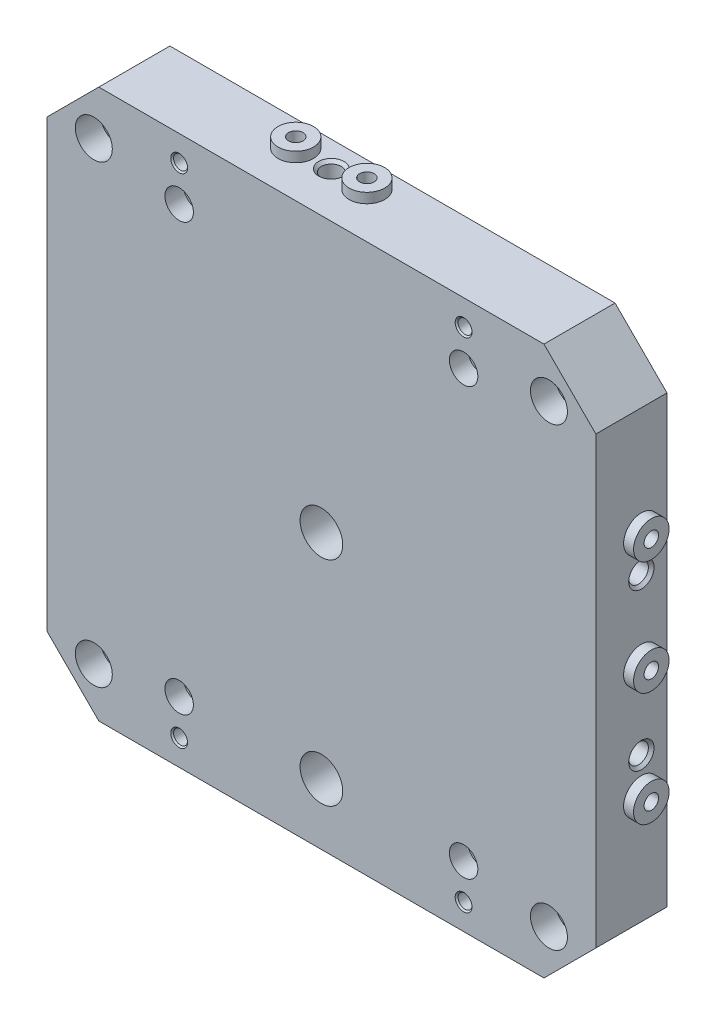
ISO-10303-21;
HEADER;
FILE_DESCRIPTION(('STEP AP214'),'2;1');
FILE_NAME('part.step','',(''),(''),'','','');
FILE_SCHEMA(('AUTOMOTIVE_DESIGN { 1 0 10303 214 1 1 1 1 }'));
ENDSEC;
DATA;
#1=APPLICATION_CONTEXT('core data for automotive mechanical design processes');
#2=APPLICATION_PROTOCOL_DEFINITION('international standard','automotive_design',2000,#1);
#3=PRODUCT_CONTEXT('',#1,'mechanical');
#4=PRODUCT('Part','Part','',(#3));
#5=PRODUCT_RELATED_PRODUCT_CATEGORY('part','',(#4));
#6=PRODUCT_DEFINITION_FORMATION('','',#4);
#7=PRODUCT_DEFINITION_CONTEXT('part definition',#1,'design');
#8=PRODUCT_DEFINITION('design','',#6,#7);
#9=PRODUCT_DEFINITION_SHAPE('','',#8);
#10=(LENGTH_UNIT() NAMED_UNIT(*) SI_UNIT(.MILLI.,.METRE.));
#11=(NAMED_UNIT(*) PLANE_ANGLE_UNIT() SI_UNIT($,.RADIAN.));
#12=(NAMED_UNIT(*) SI_UNIT($,.STERADIAN.) SOLID_ANGLE_UNIT());
#13=UNCERTAINTY_MEASURE_WITH_UNIT(LENGTH_MEASURE(1.E-05),#10,'distance_accuracy_value','');
#14=(GEOMETRIC_REPRESENTATION_CONTEXT(3) GLOBAL_UNCERTAINTY_ASSIGNED_CONTEXT((#13)) GLOBAL_UNIT_ASSIGNED_CONTEXT((#10,
#11,#12)) REPRESENTATION_CONTEXT('',''));
#15=CARTESIAN_POINT('',(0.,0.,0.));
#16=DIRECTION('',(0.,0.,1.));
#17=DIRECTION('',(1.,0.,0.));
#18=AXIS2_PLACEMENT_3D('',#15,#16,#17);
#19=CARTESIAN_POINT('',(193.,-156.5,50.));
#20=DIRECTION('',(-1.,0.,0.));
#21=DIRECTION('',(0.,0.,1.));
#22=AXIS2_PLACEMENT_3D('',#19,#20,#21);
#23=PLANE('',#22);
#24=CARTESIAN_POINT('',(193.,-55.,18.));
#25=DIRECTION('',(-1.,0.,0.));
#26=DIRECTION('',(0.,0.,1.));
#27=AXIS2_PLACEMENT_3D('',#24,#25,#26);
#28=CIRCLE('',#27,8.9175);
#29=CARTESIAN_POINT('',(193.,-55.,26.9175));
#30=VERTEX_POINT('',#29);
#31=EDGE_CURVE('E39',#30,#30,#28,.T.);
#32=ORIENTED_EDGE('',*,*,#31,.T.);
#33=EDGE_LOOP('',(#32));
#34=FACE_BOUND('',#33,.T.);
#35=CARTESIAN_POINT('',(193.,55.,18.));
#36=DIRECTION('',(-1.,0.,0.));
#37=DIRECTION('',(0.,0.,1.));
#38=AXIS2_PLACEMENT_3D('',#35,#36,#37);
#39=CIRCLE('',#38,8.9175);
#40=CARTESIAN_POINT('',(193.,55.,26.9175));
#41=VERTEX_POINT('',#40);
#42=EDGE_CURVE('E287',#41,#41,#39,.T.);
#43=ORIENTED_EDGE('',*,*,#42,.T.);
#44=EDGE_LOOP('',(#43));
#45=FACE_BOUND('',#44,.T.);
#46=CARTESIAN_POINT('',(193.,80.,18.));
#47=DIRECTION('',(-1.,0.,0.));
#48=DIRECTION('',(0.,0.,1.));
#49=AXIS2_PLACEMENT_3D('',#46,#47,#48);
#50=CIRCLE('',#49,12.5);
#51=CARTESIAN_POINT('',(193.,80.,30.5));
#52=VERTEX_POINT('',#51);
#53=EDGE_CURVE('E45',#52,#52,#50,.F.);
#54=ORIENTED_EDGE('',*,*,#53,.F.);
#55=EDGE_LOOP('',(#54));
#56=FACE_BOUND('',#55,.T.);
#57=DIRECTION('',(0.,1.,0.));
#58=VECTOR('',#57,1.);
#59=CARTESIAN_POINT('',(193.,-156.5,0.));
#60=LINE('',#59,#58);
#61=CARTESIAN_POINT('',(193.,-156.5,0.));
#62=VERTEX_POINT('',#61);
#63=CARTESIAN_POINT('',(193.,156.5,0.));
#64=VERTEX_POINT('',#63);
#65=EDGE_CURVE('E149',#62,#64,#60,.T.);
#66=ORIENTED_EDGE('',*,*,#65,.T.);
#67=DIRECTION('',(0.,0.,-1.));
#68=VECTOR('',#67,1.);
#69=CARTESIAN_POINT('',(193.,156.5,50.));
#70=LINE('',#69,#68);
#71=CARTESIAN_POINT('',(193.,156.5,50.));
#72=VERTEX_POINT('',#71);
#73=EDGE_CURVE('E129',#72,#64,#70,.T.);
#74=ORIENTED_EDGE('',*,*,#73,.F.);
#75=DIRECTION('',(0.,1.,0.));
#76=VECTOR('',#75,1.);
#77=CARTESIAN_POINT('',(193.,-156.5,50.));
#78=LINE('',#77,#76);
#79=CARTESIAN_POINT('',(193.,-156.5,50.));
#80=VERTEX_POINT('',#79);
#81=EDGE_CURVE('E120',#80,#72,#78,.T.);
#82=ORIENTED_EDGE('',*,*,#81,.F.);
#83=DIRECTION('',(0.,0.,-1.));
#84=VECTOR('',#83,1.);
#85=CARTESIAN_POINT('',(193.,-156.5,50.));
#86=LINE('',#85,#84);
#87=EDGE_CURVE('E158',#80,#62,#86,.T.);
#88=ORIENTED_EDGE('',*,*,#87,.T.);
#89=EDGE_LOOP('',(#66,#74,#82,#88));
#90=FACE_BOUND('',#89,.T.);
#91=CARTESIAN_POINT('',(193.,0.,18.));
#92=DIRECTION('',(-1.,0.,0.));
#93=DIRECTION('',(0.,0.,1.));
#94=AXIS2_PLACEMENT_3D('',#91,#92,#93);
#95=CIRCLE('',#94,12.5);
#96=CARTESIAN_POINT('',(193.,0.,30.5));
#97=VERTEX_POINT('',#96);
#98=EDGE_CURVE('E175',#97,#97,#95,.F.);
#99=ORIENTED_EDGE('',*,*,#98,.F.);
#100=EDGE_LOOP('',(#99));
#101=FACE_BOUND('',#100,.T.);
#102=CARTESIAN_POINT('',(193.,-80.,18.));
#103=DIRECTION('',(-1.,0.,0.));
#104=DIRECTION('',(0.,0.,1.));
#105=AXIS2_PLACEMENT_3D('',#102,#103,#104);
#106=CIRCLE('',#105,12.5);
#107=CARTESIAN_POINT('',(193.,-80.,30.5));
#108=VERTEX_POINT('',#107);
#109=EDGE_CURVE('E11',#108,#108,#106,.F.);
#110=ORIENTED_EDGE('',*,*,#109,.F.);
#111=EDGE_LOOP('',(#110));
#112=FACE_BOUND('',#111,.T.);
#113=ADVANCED_FACE('F35',(#34,#45,#56,#90,#101,#112),#23,.F.);
#114=CARTESIAN_POINT('',(156.5,193.,50.));
#115=DIRECTION('',(0.,-1.,0.));
#116=DIRECTION('',(0.,0.,-1.));
#117=AXIS2_PLACEMENT_3D('',#114,#115,#116);
#118=PLANE('',#117);
#119=CARTESIAN_POINT('',(-25.,193.,18.));
#120=DIRECTION('',(0.,-1.,0.));
#121=DIRECTION('',(0.,0.,-1.));
#122=AXIS2_PLACEMENT_3D('',#119,#120,#121);
#123=CIRCLE('',#122,8.9175);
#124=CARTESIAN_POINT('',(-25.,193.,9.0825));
#125=VERTEX_POINT('',#124);
#126=EDGE_CURVE('E279',#125,#125,#123,.T.);
#127=ORIENTED_EDGE('',*,*,#126,.T.);
#128=EDGE_LOOP('',(#127));
#129=FACE_BOUND('',#128,.T.);
#130=CARTESIAN_POINT('',(0.,193.,18.));
#131=DIRECTION('',(0.,-1.,0.));
#132=DIRECTION('',(0.,0.,-1.));
#133=AXIS2_PLACEMENT_3D('',#130,#131,#132);
#134=CIRCLE('',#133,12.5);
#135=CARTESIAN_POINT('',(0.,193.,5.5));
#136=VERTEX_POINT('',#135);
#137=EDGE_CURVE('E169',#136,#136,#134,.F.);
#138=ORIENTED_EDGE('',*,*,#137,.F.);
#139=EDGE_LOOP('',(#138));
#140=FACE_BOUND('',#139,.T.);
#141=DIRECTION('',(-1.,0.,0.));
#142=VECTOR('',#141,1.);
#143=CARTESIAN_POINT('',(156.5,193.,0.));
#144=LINE('',#143,#142);
#145=CARTESIAN_POINT('',(156.5,193.,0.));
#146=VERTEX_POINT('',#145);
#147=CARTESIAN_POINT('',(-156.5,193.,0.));
#148=VERTEX_POINT('',#147);
#149=EDGE_CURVE('E84',#146,#148,#144,.T.);
#150=ORIENTED_EDGE('',*,*,#149,.T.);
#151=DIRECTION('',(0.,0.,-1.));
#152=VECTOR('',#151,1.);
#153=CARTESIAN_POINT('',(-156.5,193.,50.));
#154=LINE('',#153,#152);
#155=CARTESIAN_POINT('',(-156.5,193.,50.));
#156=VERTEX_POINT('',#155);
#157=EDGE_CURVE('E130',#156,#148,#154,.T.);
#158=ORIENTED_EDGE('',*,*,#157,.F.);
#159=DIRECTION('',(-1.,0.,0.));
#160=VECTOR('',#159,1.);
#161=CARTESIAN_POINT('',(156.5,193.,50.));
#162=LINE('',#161,#160);
#163=CARTESIAN_POINT('',(156.5,193.,50.));
#164=VERTEX_POINT('',#163);
#165=EDGE_CURVE('E118',#164,#156,#162,.T.);
#166=ORIENTED_EDGE('',*,*,#165,.F.);
#167=DIRECTION('',(0.,0.,-1.));
#168=VECTOR('',#167,1.);
#169=CARTESIAN_POINT('',(156.5,193.,50.));
#170=LINE('',#169,#168);
#171=EDGE_CURVE('E125',#164,#146,#170,.T.);
#172=ORIENTED_EDGE('',*,*,#171,.T.);
#173=EDGE_LOOP('',(#150,#158,#166,#172));
#174=FACE_BOUND('',#173,.T.);
#175=CARTESIAN_POINT('',(-50.,193.,18.));
#176=DIRECTION('',(0.,-1.,0.));
#177=DIRECTION('',(0.,0.,-1.));
#178=AXIS2_PLACEMENT_3D('',#175,#176,#177);
#179=CIRCLE('',#178,12.5);
#180=CARTESIAN_POINT('',(-50.,193.,5.50000000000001));
#181=VERTEX_POINT('',#180);
#182=EDGE_CURVE('E172',#181,#181,#179,.F.);
#183=ORIENTED_EDGE('',*,*,#182,.F.);
#184=EDGE_LOOP('',(#183));
#185=FACE_BOUND('',#184,.T.);
#186=ADVANCED_FACE('F132',(#129,#140,#174,#185),#118,.F.);
#187=CARTESIAN_POINT('',(-193.,156.5,50.));
#188=DIRECTION('',(1.,0.,0.));
#189=DIRECTION('',(0.,0.,-1.));
#190=AXIS2_PLACEMENT_3D('',#187,#188,#189);
#191=PLANE('',#190);
#192=DIRECTION('',(0.,-1.,0.));
#193=VECTOR('',#192,1.);
#194=CARTESIAN_POINT('',(-193.,156.5,0.));
#195=LINE('',#194,#193);
#196=CARTESIAN_POINT('',(-193.,156.5,0.));
#197=VERTEX_POINT('',#196);
#198=CARTESIAN_POINT('',(-193.,-156.5,0.));
#199=VERTEX_POINT('',#198);
#200=EDGE_CURVE('E139',#197,#199,#195,.T.);
#201=ORIENTED_EDGE('',*,*,#200,.T.);
#202=DIRECTION('',(0.,0.,-1.));
#203=VECTOR('',#202,1.);
#204=CARTESIAN_POINT('',(-193.,-156.5,50.));
#205=LINE('',#204,#203);
#206=CARTESIAN_POINT('',(-193.,-156.5,50.));
#207=VERTEX_POINT('',#206);
#208=EDGE_CURVE('E167',#207,#199,#205,.T.);
#209=ORIENTED_EDGE('',*,*,#208,.F.);
#210=DIRECTION('',(0.,-1.,0.));
#211=VECTOR('',#210,1.);
#212=CARTESIAN_POINT('',(-193.,156.5,50.));
#213=LINE('',#212,#211);
#214=CARTESIAN_POINT('',(-193.,156.5,50.));
#215=VERTEX_POINT('',#214);
#216=EDGE_CURVE('E154',#215,#207,#213,.T.);
#217=ORIENTED_EDGE('',*,*,#216,.F.);
#218=DIRECTION('',(0.,0.,-1.));
#219=VECTOR('',#218,1.);
#220=CARTESIAN_POINT('',(-193.,156.5,50.));
#221=LINE('',#220,#219);
#222=EDGE_CURVE('E135',#215,#197,#221,.T.);
#223=ORIENTED_EDGE('',*,*,#222,.T.);
#224=EDGE_LOOP('',(#201,#209,#217,#223));
#225=FACE_BOUND('',#224,.T.);
#226=ADVANCED_FACE('F37',(#225),#191,.F.);
#227=CARTESIAN_POINT('',(-193.,-156.5,50.));
#228=DIRECTION('',(0.707106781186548,0.707106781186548,0.));
#229=DIRECTION('',(-0.707106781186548,0.707106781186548,0.));
#230=AXIS2_PLACEMENT_3D('',#227,#228,#229);
#231=PLANE('',#230);
#232=DIRECTION('',(0.707106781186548,-0.707106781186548,0.));
#233=VECTOR('',#232,1.);
#234=CARTESIAN_POINT('',(-193.,-156.5,0.));
#235=LINE('',#234,#233);
#236=CARTESIAN_POINT('',(-156.5,-193.,0.));
#237=VERTEX_POINT('',#236);
#238=EDGE_CURVE('E142',#199,#237,#235,.T.);
#239=ORIENTED_EDGE('',*,*,#238,.T.);
#240=DIRECTION('',(0.,0.,-1.));
#241=VECTOR('',#240,1.);
#242=CARTESIAN_POINT('',(-156.5,-193.,50.));
#243=LINE('',#242,#241);
#244=CARTESIAN_POINT('',(-156.5,-193.,50.));
#245=VERTEX_POINT('',#244);
#246=EDGE_CURVE('E164',#245,#237,#243,.T.);
#247=ORIENTED_EDGE('',*,*,#246,.F.);
#248=DIRECTION('',(0.707106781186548,-0.707106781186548,0.));
#249=VECTOR('',#248,1.);
#250=CARTESIAN_POINT('',(-193.,-156.5,50.));
#251=LINE('',#250,#249);
#252=EDGE_CURVE('E99',#207,#245,#251,.T.);
#253=ORIENTED_EDGE('',*,*,#252,.F.);
#254=ORIENTED_EDGE('',*,*,#208,.T.);
#255=EDGE_LOOP('',(#239,#247,#253,#254));
#256=FACE_BOUND('',#255,.T.);
#257=ADVANCED_FACE('F419',(#256),#231,.F.);
#258=CARTESIAN_POINT('',(-156.5,-193.,50.));
#259=DIRECTION('',(0.,1.,0.));
#260=DIRECTION('',(0.,0.,1.));
#261=AXIS2_PLACEMENT_3D('',#258,#259,#260);
#262=PLANE('',#261);
#263=DIRECTION('',(1.,0.,0.));
#264=VECTOR('',#263,1.);
#265=CARTESIAN_POINT('',(-156.5,-193.,0.));
#266=LINE('',#265,#264);
#267=CARTESIAN_POINT('',(156.5,-193.,0.));
#268=VERTEX_POINT('',#267);
#269=EDGE_CURVE('E145',#237,#268,#266,.T.);
#270=ORIENTED_EDGE('',*,*,#269,.T.);
#271=DIRECTION('',(0.,0.,-1.));
#272=VECTOR('',#271,1.);
#273=CARTESIAN_POINT('',(156.5,-193.,50.));
#274=LINE('',#273,#272);
#275=CARTESIAN_POINT('',(156.5,-193.,50.));
#276=VERTEX_POINT('',#275);
#277=EDGE_CURVE('E161',#276,#268,#274,.T.);
#278=ORIENTED_EDGE('',*,*,#277,.F.);
#279=DIRECTION('',(1.,0.,0.));
#280=VECTOR('',#279,1.);
#281=CARTESIAN_POINT('',(-156.5,-193.,50.));
#282=LINE('',#281,#280);
#283=EDGE_CURVE('E374',#245,#276,#282,.T.);
#284=ORIENTED_EDGE('',*,*,#283,.F.);
#285=ORIENTED_EDGE('',*,*,#246,.T.);
#286=EDGE_LOOP('',(#270,#278,#284,#285));
#287=FACE_BOUND('',#286,.T.);
#288=ADVANCED_FACE('F417',(#287),#262,.F.);
#289=CARTESIAN_POINT('',(156.5,-193.,50.));
#290=DIRECTION('',(-0.707106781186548,0.707106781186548,0.));
#291=DIRECTION('',(-0.707106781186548,-0.707106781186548,0.));
#292=AXIS2_PLACEMENT_3D('',#289,#290,#291);
#293=PLANE('',#292);
#294=DIRECTION('',(0.707106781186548,0.707106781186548,0.));
#295=VECTOR('',#294,1.);
#296=CARTESIAN_POINT('',(156.5,-193.,0.));
#297=LINE('',#296,#295);
#298=EDGE_CURVE('E147',#268,#62,#297,.T.);
#299=ORIENTED_EDGE('',*,*,#298,.T.);
#300=ORIENTED_EDGE('',*,*,#87,.F.);
#301=DIRECTION('',(0.707106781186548,0.707106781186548,0.));
#302=VECTOR('',#301,1.);
#303=CARTESIAN_POINT('',(156.5,-193.,50.));
#304=LINE('',#303,#302);
#305=EDGE_CURVE('E376',#276,#80,#304,.T.);
#306=ORIENTED_EDGE('',*,*,#305,.F.);
#307=ORIENTED_EDGE('',*,*,#277,.T.);
#308=EDGE_LOOP('',(#299,#300,#306,#307));
#309=FACE_BOUND('',#308,.T.);
#310=ADVANCED_FACE('F382',(#309),#293,.F.);
#311=CARTESIAN_POINT('',(193.,156.5,50.));
#312=DIRECTION('',(-0.707106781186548,-0.707106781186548,0.));
#313=DIRECTION('',(0.707106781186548,-0.707106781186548,0.));
#314=AXIS2_PLACEMENT_3D('',#311,#312,#313);
#315=PLANE('',#314);
#316=DIRECTION('',(-0.707106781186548,0.707106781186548,0.));
#317=VECTOR('',#316,1.);
#318=CARTESIAN_POINT('',(193.,156.5,0.));
#319=LINE('',#318,#317);
#320=EDGE_CURVE('E128',#64,#146,#319,.T.);
#321=ORIENTED_EDGE('',*,*,#320,.T.);
#322=ORIENTED_EDGE('',*,*,#171,.F.);
#323=DIRECTION('',(-0.707106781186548,0.707106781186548,0.));
#324=VECTOR('',#323,1.);
#325=CARTESIAN_POINT('',(193.,156.5,50.));
#326=LINE('',#325,#324);
#327=EDGE_CURVE('E114',#72,#164,#326,.T.);
#328=ORIENTED_EDGE('',*,*,#327,.F.);
#329=ORIENTED_EDGE('',*,*,#73,.T.);
#330=EDGE_LOOP('',(#321,#322,#328,#329));
#331=FACE_BOUND('',#330,.T.);
#332=ADVANCED_FACE('F126',(#331),#315,.F.);
#333=CARTESIAN_POINT('',(-156.5,193.,50.));
#334=DIRECTION('',(0.707106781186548,-0.707106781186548,0.));
#335=DIRECTION('',(0.707106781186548,0.707106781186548,0.));
#336=AXIS2_PLACEMENT_3D('',#333,#334,#335);
#337=PLANE('',#336);
#338=DIRECTION('',(-0.707106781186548,-0.707106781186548,0.));
#339=VECTOR('',#338,1.);
#340=CARTESIAN_POINT('',(-156.5,193.,0.));
#341=LINE('',#340,#339);
#342=EDGE_CURVE('E90',#148,#197,#341,.T.);
#343=ORIENTED_EDGE('',*,*,#342,.T.);
#344=ORIENTED_EDGE('',*,*,#222,.F.);
#345=DIRECTION('',(-0.707106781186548,-0.707106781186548,0.));
#346=VECTOR('',#345,1.);
#347=CARTESIAN_POINT('',(-156.5,193.,50.));
#348=LINE('',#347,#346);
#349=EDGE_CURVE('E54',#156,#215,#348,.T.);
#350=ORIENTED_EDGE('',*,*,#349,.F.);
#351=ORIENTED_EDGE('',*,*,#157,.T.);
#352=EDGE_LOOP('',(#343,#344,#350,#351));
#353=FACE_BOUND('',#352,.T.);
#354=ADVANCED_FACE('F394',(#353),#337,.F.);
#355=CARTESIAN_POINT('',(-193.,-193.,50.));
#356=DIRECTION('',(0.,0.,1.));
#357=DIRECTION('',(1.,0.,0.));
#358=AXIS2_PLACEMENT_3D('',#355,#356,#357);
#359=PLANE('',#358);
#360=CARTESIAN_POINT('',(100.,-175.,50.));
#361=DIRECTION('',(0.,0.,1.));
#362=DIRECTION('',(1.,0.,0.));
#363=AXIS2_PLACEMENT_3D('',#360,#361,#362);
#364=CIRCLE('',#363,5.917);
#365=CARTESIAN_POINT('',(105.917,-175.,50.));
#366=VERTEX_POINT('',#365);
#367=EDGE_CURVE('E274',#366,#366,#364,.T.);
#368=ORIENTED_EDGE('',*,*,#367,.F.);
#369=EDGE_LOOP('',(#368));
#370=FACE_BOUND('',#369,.T.);
#371=CARTESIAN_POINT('',(-100.,-175.,50.));
#372=DIRECTION('',(0.,0.,1.));
#373=DIRECTION('',(1.,0.,0.));
#374=AXIS2_PLACEMENT_3D('',#371,#372,#373);
#375=CIRCLE('',#374,5.91700000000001);
#376=CARTESIAN_POINT('',(-94.083,-175.,50.));
#377=VERTEX_POINT('',#376);
#378=EDGE_CURVE('E266',#377,#377,#375,.T.);
#379=ORIENTED_EDGE('',*,*,#378,.F.);
#380=EDGE_LOOP('',(#379));
#381=FACE_BOUND('',#380,.T.);
#382=CARTESIAN_POINT('',(100.,175.,50.));
#383=DIRECTION('',(0.,0.,1.));
#384=DIRECTION('',(1.,0.,0.));
#385=AXIS2_PLACEMENT_3D('',#382,#383,#384);
#386=CIRCLE('',#385,5.917);
#387=CARTESIAN_POINT('',(105.917,175.,50.));
#388=VERTEX_POINT('',#387);
#389=EDGE_CURVE('E258',#388,#388,#386,.T.);
#390=ORIENTED_EDGE('',*,*,#389,.F.);
#391=EDGE_LOOP('',(#390));
#392=FACE_BOUND('',#391,.T.);
#393=CARTESIAN_POINT('',(-100.,175.,50.));
#394=DIRECTION('',(0.,0.,1.));
#395=DIRECTION('',(1.,0.,0.));
#396=AXIS2_PLACEMENT_3D('',#393,#394,#395);
#397=CIRCLE('',#396,5.91700000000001);
#398=CARTESIAN_POINT('',(-94.083,175.,50.));
#399=VERTEX_POINT('',#398);
#400=EDGE_CURVE('E250',#399,#399,#397,.T.);
#401=ORIENTED_EDGE('',*,*,#400,.F.);
#402=EDGE_LOOP('',(#401));
#403=FACE_BOUND('',#402,.T.);
#404=CARTESIAN_POINT('',(-100.,-150.,50.));
#405=DIRECTION('',(0.,0.,1.));
#406=DIRECTION('',(1.,0.,0.));
#407=AXIS2_PLACEMENT_3D('',#404,#405,#406);
#408=CIRCLE('',#407,9.99999999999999);
#409=CARTESIAN_POINT('',(-90.,-150.,50.));
#410=VERTEX_POINT('',#409);
#411=EDGE_CURVE('E242',#410,#410,#408,.T.);
#412=ORIENTED_EDGE('',*,*,#411,.F.);
#413=EDGE_LOOP('',(#412));
#414=FACE_BOUND('',#413,.T.);
#415=CARTESIAN_POINT('',(100.,-150.,50.));
#416=DIRECTION('',(0.,0.,1.));
#417=DIRECTION('',(1.,0.,0.));
#418=AXIS2_PLACEMENT_3D('',#415,#416,#417);
#419=CIRCLE('',#418,10.);
#420=CARTESIAN_POINT('',(110.,-150.,50.));
#421=VERTEX_POINT('',#420);
#422=EDGE_CURVE('E234',#421,#421,#419,.T.);
#423=ORIENTED_EDGE('',*,*,#422,.F.);
#424=EDGE_LOOP('',(#423));
#425=FACE_BOUND('',#424,.T.);
#426=CARTESIAN_POINT('',(-100.,150.,50.));
#427=DIRECTION('',(0.,0.,1.));
#428=DIRECTION('',(1.,0.,0.));
#429=AXIS2_PLACEMENT_3D('',#426,#427,#428);
#430=CIRCLE('',#429,9.99999999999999);
#431=CARTESIAN_POINT('',(-90.,150.,50.));
#432=VERTEX_POINT('',#431);
#433=EDGE_CURVE('E226',#432,#432,#430,.T.);
#434=ORIENTED_EDGE('',*,*,#433,.F.);
#435=EDGE_LOOP('',(#434));
#436=FACE_BOUND('',#435,.T.);
#437=CARTESIAN_POINT('',(100.,150.,50.));
#438=DIRECTION('',(0.,0.,1.));
#439=DIRECTION('',(1.,0.,0.));
#440=AXIS2_PLACEMENT_3D('',#437,#438,#439);
#441=CIRCLE('',#440,10.);
#442=CARTESIAN_POINT('',(110.,150.,50.));
#443=VERTEX_POINT('',#442);
#444=EDGE_CURVE('E216',#443,#443,#441,.T.);
#445=ORIENTED_EDGE('',*,*,#444,.F.);
#446=EDGE_LOOP('',(#445));
#447=FACE_BOUND('',#446,.T.);
#448=CARTESIAN_POINT('',(0.,-150.,50.));
#449=DIRECTION('',(0.,0.,1.));
#450=DIRECTION('',(1.,0.,0.));
#451=AXIS2_PLACEMENT_3D('',#448,#449,#450);
#452=CIRCLE('',#451,15.);
#453=CARTESIAN_POINT('',(15.,-150.,50.));
#454=VERTEX_POINT('',#453);
#455=EDGE_CURVE('E212',#454,#454,#452,.T.);
#456=ORIENTED_EDGE('',*,*,#455,.F.);
#457=EDGE_LOOP('',(#456));
#458=FACE_BOUND('',#457,.T.);
#459=CARTESIAN_POINT('',(0.,0.,50.));
#460=DIRECTION('',(0.,0.,1.));
#461=DIRECTION('',(1.,0.,0.));
#462=AXIS2_PLACEMENT_3D('',#459,#460,#461);
#463=CIRCLE('',#462,15.);
#464=CARTESIAN_POINT('',(15.,0.,50.));
#465=VERTEX_POINT('',#464);
#466=EDGE_CURVE('E211',#465,#465,#463,.T.);
#467=ORIENTED_EDGE('',*,*,#466,.F.);
#468=EDGE_LOOP('',(#467));
#469=FACE_BOUND('',#468,.T.);
#470=CARTESIAN_POINT('',(-160.,-160.,50.));
#471=DIRECTION('',(0.,0.,1.));
#472=DIRECTION('',(1.,0.,0.));
#473=AXIS2_PLACEMENT_3D('',#470,#471,#472);
#474=CIRCLE('',#473,13.);
#475=CARTESIAN_POINT('',(-147.,-160.,50.));
#476=VERTEX_POINT('',#475);
#477=EDGE_CURVE('E203',#476,#476,#474,.T.);
#478=ORIENTED_EDGE('',*,*,#477,.F.);
#479=EDGE_LOOP('',(#478));
#480=FACE_BOUND('',#479,.T.);
#481=CARTESIAN_POINT('',(160.,-160.,50.));
#482=DIRECTION('',(0.,0.,1.));
#483=DIRECTION('',(1.,0.,0.));
#484=AXIS2_PLACEMENT_3D('',#481,#482,#483);
#485=CIRCLE('',#484,13.);
#486=CARTESIAN_POINT('',(173.,-160.,50.));
#487=VERTEX_POINT('',#486);
#488=EDGE_CURVE('E195',#487,#487,#485,.T.);
#489=ORIENTED_EDGE('',*,*,#488,.F.);
#490=EDGE_LOOP('',(#489));
#491=FACE_BOUND('',#490,.T.);
#492=CARTESIAN_POINT('',(160.,160.,50.));
#493=DIRECTION('',(0.,0.,1.));
#494=DIRECTION('',(1.,0.,0.));
#495=AXIS2_PLACEMENT_3D('',#492,#493,#494);
#496=CIRCLE('',#495,13.);
#497=CARTESIAN_POINT('',(173.,160.,50.));
#498=VERTEX_POINT('',#497);
#499=EDGE_CURVE('E187',#498,#498,#496,.T.);
#500=ORIENTED_EDGE('',*,*,#499,.F.);
#501=EDGE_LOOP('',(#500));
#502=FACE_BOUND('',#501,.T.);
#503=CARTESIAN_POINT('',(-160.,160.,50.));
#504=DIRECTION('',(0.,0.,1.));
#505=DIRECTION('',(1.,0.,0.));
#506=AXIS2_PLACEMENT_3D('',#503,#504,#505);
#507=CIRCLE('',#506,13.);
#508=CARTESIAN_POINT('',(-147.,160.,50.));
#509=VERTEX_POINT('',#508);
#510=EDGE_CURVE('E179',#509,#509,#507,.T.);
#511=ORIENTED_EDGE('',*,*,#510,.F.);
#512=EDGE_LOOP('',(#511));
#513=FACE_BOUND('',#512,.T.);
#514=ORIENTED_EDGE('',*,*,#216,.T.);
#515=ORIENTED_EDGE('',*,*,#252,.T.);
#516=ORIENTED_EDGE('',*,*,#283,.T.);
#517=ORIENTED_EDGE('',*,*,#305,.T.);
#518=ORIENTED_EDGE('',*,*,#81,.T.);
#519=ORIENTED_EDGE('',*,*,#327,.T.);
#520=ORIENTED_EDGE('',*,*,#165,.T.);
#521=ORIENTED_EDGE('',*,*,#349,.T.);
#522=EDGE_LOOP('',(#514,#515,#516,#517,#518,#519,#520,#521));
#523=FACE_BOUND('',#522,.T.);
#524=ADVANCED_FACE('F116',(#370,#381,#392,#403,#414,#425,#436,#447,#458,#469,#480,#491,#502,
#513,#523),#359,.T.);
#525=CARTESIAN_POINT('',(-193.,-193.,0.));
#526=DIRECTION('',(0.,0.,1.));
#527=DIRECTION('',(1.,0.,0.));
#528=AXIS2_PLACEMENT_3D('',#525,#526,#527);
#529=PLANE('',#528);
#530=CARTESIAN_POINT('',(100.,-175.,0.));
#531=DIRECTION('',(0.,0.,1.));
#532=DIRECTION('',(1.,0.,0.));
#533=AXIS2_PLACEMENT_3D('',#530,#531,#532);
#534=CIRCLE('',#533,5.917);
#535=CARTESIAN_POINT('',(105.917,-175.,0.));
#536=VERTEX_POINT('',#535);
#537=EDGE_CURVE('E271',#536,#536,#534,.T.);
#538=ORIENTED_EDGE('',*,*,#537,.T.);
#539=EDGE_LOOP('',(#538));
#540=FACE_BOUND('',#539,.T.);
#541=CARTESIAN_POINT('',(-100.,-175.,0.));
#542=DIRECTION('',(0.,0.,1.));
#543=DIRECTION('',(1.,0.,0.));
#544=AXIS2_PLACEMENT_3D('',#541,#542,#543);
#545=CIRCLE('',#544,5.917);
#546=CARTESIAN_POINT('',(-94.083,-175.,0.));
#547=VERTEX_POINT('',#546);
#548=EDGE_CURVE('E263',#547,#547,#545,.T.);
#549=ORIENTED_EDGE('',*,*,#548,.T.);
#550=EDGE_LOOP('',(#549));
#551=FACE_BOUND('',#550,.T.);
#552=CARTESIAN_POINT('',(100.,175.,0.));
#553=DIRECTION('',(0.,0.,1.));
#554=DIRECTION('',(1.,0.,0.));
#555=AXIS2_PLACEMENT_3D('',#552,#553,#554);
#556=CIRCLE('',#555,5.917);
#557=CARTESIAN_POINT('',(105.917,175.,0.));
#558=VERTEX_POINT('',#557);
#559=EDGE_CURVE('E255',#558,#558,#556,.T.);
#560=ORIENTED_EDGE('',*,*,#559,.T.);
#561=EDGE_LOOP('',(#560));
#562=FACE_BOUND('',#561,.T.);
#563=CARTESIAN_POINT('',(-100.,175.,0.));
#564=DIRECTION('',(0.,0.,1.));
#565=DIRECTION('',(1.,0.,0.));
#566=AXIS2_PLACEMENT_3D('',#563,#564,#565);
#567=CIRCLE('',#566,5.917);
#568=CARTESIAN_POINT('',(-94.083,175.,0.));
#569=VERTEX_POINT('',#568);
#570=EDGE_CURVE('E247',#569,#569,#567,.T.);
#571=ORIENTED_EDGE('',*,*,#570,.T.);
#572=EDGE_LOOP('',(#571));
#573=FACE_BOUND('',#572,.T.);
#574=CARTESIAN_POINT('',(-100.,-150.,0.));
#575=DIRECTION('',(0.,0.,1.));
#576=DIRECTION('',(1.,0.,0.));
#577=AXIS2_PLACEMENT_3D('',#574,#575,#576);
#578=CIRCLE('',#577,6.74999999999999);
#579=CARTESIAN_POINT('',(-93.25,-150.,0.));
#580=VERTEX_POINT('',#579);
#581=EDGE_CURVE('E239',#580,#580,#578,.T.);
#582=ORIENTED_EDGE('',*,*,#581,.T.);
#583=EDGE_LOOP('',(#582));
#584=FACE_BOUND('',#583,.T.);
#585=CARTESIAN_POINT('',(100.,-150.,0.));
#586=DIRECTION('',(0.,0.,1.));
#587=DIRECTION('',(1.,0.,0.));
#588=AXIS2_PLACEMENT_3D('',#585,#586,#587);
#589=CIRCLE('',#588,6.75000000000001);
#590=CARTESIAN_POINT('',(106.75,-150.,0.));
#591=VERTEX_POINT('',#590);
#592=EDGE_CURVE('E231',#591,#591,#589,.T.);
#593=ORIENTED_EDGE('',*,*,#592,.T.);
#594=EDGE_LOOP('',(#593));
#595=FACE_BOUND('',#594,.T.);
#596=CARTESIAN_POINT('',(-100.,150.,0.));
#597=DIRECTION('',(0.,0.,1.));
#598=DIRECTION('',(1.,0.,0.));
#599=AXIS2_PLACEMENT_3D('',#596,#597,#598);
#600=CIRCLE('',#599,6.74999999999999);
#601=CARTESIAN_POINT('',(-93.25,150.,0.));
#602=VERTEX_POINT('',#601);
#603=EDGE_CURVE('E223',#602,#602,#600,.T.);
#604=ORIENTED_EDGE('',*,*,#603,.T.);
#605=EDGE_LOOP('',(#604));
#606=FACE_BOUND('',#605,.T.);
#607=CARTESIAN_POINT('',(100.,150.,0.));
#608=DIRECTION('',(0.,0.,1.));
#609=DIRECTION('',(1.,0.,0.));
#610=AXIS2_PLACEMENT_3D('',#607,#608,#609);
#611=CIRCLE('',#610,6.75000000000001);
#612=CARTESIAN_POINT('',(106.75,150.,0.));
#613=VERTEX_POINT('',#612);
#614=EDGE_CURVE('E217',#613,#613,#611,.T.);
#615=ORIENTED_EDGE('',*,*,#614,.T.);
#616=EDGE_LOOP('',(#615));
#617=FACE_BOUND('',#616,.T.);
#618=CARTESIAN_POINT('',(0.,-150.,0.));
#619=DIRECTION('',(0.,0.,1.));
#620=DIRECTION('',(1.,0.,0.));
#621=AXIS2_PLACEMENT_3D('',#618,#619,#620);
#622=CIRCLE('',#621,15.);
#623=CARTESIAN_POINT('',(15.,-150.,0.));
#624=VERTEX_POINT('',#623);
#625=EDGE_CURVE('E213',#624,#624,#622,.T.);
#626=ORIENTED_EDGE('',*,*,#625,.T.);
#627=EDGE_LOOP('',(#626));
#628=FACE_BOUND('',#627,.T.);
#629=CARTESIAN_POINT('',(0.,0.,0.));
#630=DIRECTION('',(0.,0.,1.));
#631=DIRECTION('',(1.,0.,0.));
#632=AXIS2_PLACEMENT_3D('',#629,#630,#631);
#633=CIRCLE('',#632,15.);
#634=CARTESIAN_POINT('',(15.,0.,0.));
#635=VERTEX_POINT('',#634);
#636=EDGE_CURVE('E208',#635,#635,#633,.T.);
#637=ORIENTED_EDGE('',*,*,#636,.T.);
#638=EDGE_LOOP('',(#637));
#639=FACE_BOUND('',#638,.T.);
#640=CARTESIAN_POINT('',(-160.,-160.,0.));
#641=DIRECTION('',(0.,0.,1.));
#642=DIRECTION('',(1.,0.,0.));
#643=AXIS2_PLACEMENT_3D('',#640,#641,#642);
#644=CIRCLE('',#643,8.75000000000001);
#645=CARTESIAN_POINT('',(-151.25,-160.,0.));
#646=VERTEX_POINT('',#645);
#647=EDGE_CURVE('E200',#646,#646,#644,.T.);
#648=ORIENTED_EDGE('',*,*,#647,.T.);
#649=EDGE_LOOP('',(#648));
#650=FACE_BOUND('',#649,.T.);
#651=CARTESIAN_POINT('',(160.,-160.,0.));
#652=DIRECTION('',(0.,0.,1.));
#653=DIRECTION('',(1.,0.,0.));
#654=AXIS2_PLACEMENT_3D('',#651,#652,#653);
#655=CIRCLE('',#654,8.75000000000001);
#656=CARTESIAN_POINT('',(168.75,-160.,0.));
#657=VERTEX_POINT('',#656);
#658=EDGE_CURVE('E192',#657,#657,#655,.T.);
#659=ORIENTED_EDGE('',*,*,#658,.T.);
#660=EDGE_LOOP('',(#659));
#661=FACE_BOUND('',#660,.T.);
#662=CARTESIAN_POINT('',(160.,160.,0.));
#663=DIRECTION('',(0.,0.,1.));
#664=DIRECTION('',(1.,0.,0.));
#665=AXIS2_PLACEMENT_3D('',#662,#663,#664);
#666=CIRCLE('',#665,8.75000000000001);
#667=CARTESIAN_POINT('',(168.75,160.,0.));
#668=VERTEX_POINT('',#667);
#669=EDGE_CURVE('E184',#668,#668,#666,.T.);
#670=ORIENTED_EDGE('',*,*,#669,.T.);
#671=EDGE_LOOP('',(#670));
#672=FACE_BOUND('',#671,.T.);
#673=CARTESIAN_POINT('',(-160.,160.,0.));
#674=DIRECTION('',(0.,0.,1.));
#675=DIRECTION('',(1.,0.,0.));
#676=AXIS2_PLACEMENT_3D('',#673,#674,#675);
#677=CIRCLE('',#676,8.75000000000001);
#678=CARTESIAN_POINT('',(-151.25,160.,0.));
#679=VERTEX_POINT('',#678);
#680=EDGE_CURVE('E176',#679,#679,#677,.T.);
#681=ORIENTED_EDGE('',*,*,#680,.T.);
#682=EDGE_LOOP('',(#681));
#683=FACE_BOUND('',#682,.T.);
#684=ORIENTED_EDGE('',*,*,#200,.F.);
#685=ORIENTED_EDGE('',*,*,#342,.F.);
#686=ORIENTED_EDGE('',*,*,#149,.F.);
#687=ORIENTED_EDGE('',*,*,#320,.F.);
#688=ORIENTED_EDGE('',*,*,#65,.F.);
#689=ORIENTED_EDGE('',*,*,#298,.F.);
#690=ORIENTED_EDGE('',*,*,#269,.F.);
#691=ORIENTED_EDGE('',*,*,#238,.F.);
#692=EDGE_LOOP('',(#684,#685,#686,#687,#688,#689,#690,#691));
#693=FACE_BOUND('',#692,.T.);
#694=ADVANCED_FACE('F389',(#540,#551,#562,#573,#584,#595,#606,#617,#628,#639,#650,#661,#672,
#683,#693),#529,.F.);
#695=CARTESIAN_POINT('',(0.,200.,18.));
#696=DIRECTION('',(0.,-1.,0.));
#697=DIRECTION('',(0.,0.,-1.));
#698=AXIS2_PLACEMENT_3D('',#695,#696,#697);
#699=CYLINDRICAL_SURFACE('',#698,12.5);
#700=CARTESIAN_POINT('',(0.,200.,18.));
#701=DIRECTION('',(0.,1.,0.));
#702=DIRECTION('',(0.,0.,1.));
#703=AXIS2_PLACEMENT_3D('',#700,#701,#702);
#704=CIRCLE('',#703,12.5);
#705=CARTESIAN_POINT('',(0.,200.,30.5));
#706=VERTEX_POINT('',#705);
#707=EDGE_CURVE('E143',#706,#706,#704,.T.);
#708=ORIENTED_EDGE('',*,*,#707,.F.);
#709=EDGE_LOOP('',(#708));
#710=FACE_BOUND('',#709,.T.);
#711=ORIENTED_EDGE('',*,*,#137,.T.);
#712=EDGE_LOOP('',(#711));
#713=FACE_BOUND('',#712,.T.);
#714=ADVANCED_FACE('F445',(#710,#713),#699,.T.);
#715=CARTESIAN_POINT('',(0.,200.,18.));
#716=DIRECTION('',(0.,1.,0.));
#717=DIRECTION('',(0.,0.,1.));
#718=AXIS2_PLACEMENT_3D('',#715,#716,#717);
#719=PLANE('',#718);
#720=CARTESIAN_POINT('',(0.,200.,18.));
#721=DIRECTION('',(0.,1.,0.));
#722=DIRECTION('',(0.,0.,1.));
#723=AXIS2_PLACEMENT_3D('',#720,#721,#722);
#724=CIRCLE('',#723,5.09999999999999);
#725=CARTESIAN_POINT('',(0.,200.,23.1));
#726=VERTEX_POINT('',#725);
#727=EDGE_CURVE('E1326',#726,#726,#724,.T.);
#728=ORIENTED_EDGE('',*,*,#727,.F.);
#729=EDGE_LOOP('',(#728));
#730=FACE_BOUND('',#729,.T.);
#731=ORIENTED_EDGE('',*,*,#707,.T.);
#732=EDGE_LOOP('',(#731));
#733=FACE_BOUND('',#732,.T.);
#734=ADVANCED_FACE('F507',(#730,#733),#719,.T.);
#735=CARTESIAN_POINT('',(-50.,200.,18.));
#736=DIRECTION('',(0.,-1.,0.));
#737=DIRECTION('',(0.,0.,-1.));
#738=AXIS2_PLACEMENT_3D('',#735,#736,#737);
#739=CYLINDRICAL_SURFACE('',#738,12.5);
#740=CARTESIAN_POINT('',(-50.,200.,18.));
#741=DIRECTION('',(0.,1.,0.));
#742=DIRECTION('',(0.,0.,1.));
#743=AXIS2_PLACEMENT_3D('',#740,#741,#742);
#744=CIRCLE('',#743,12.5);
#745=CARTESIAN_POINT('',(-50.,200.,30.5));
#746=VERTEX_POINT('',#745);
#747=EDGE_CURVE('E183',#746,#746,#744,.T.);
#748=ORIENTED_EDGE('',*,*,#747,.F.);
#749=EDGE_LOOP('',(#748));
#750=FACE_BOUND('',#749,.T.);
#751=ORIENTED_EDGE('',*,*,#182,.T.);
#752=EDGE_LOOP('',(#751));
#753=FACE_BOUND('',#752,.T.);
#754=ADVANCED_FACE('F517',(#750,#753),#739,.T.);
#755=CARTESIAN_POINT('',(-50.,200.,18.));
#756=DIRECTION('',(0.,1.,0.));
#757=DIRECTION('',(0.,0.,1.));
#758=AXIS2_PLACEMENT_3D('',#755,#756,#757);
#759=PLANE('',#758);
#760=CARTESIAN_POINT('',(-50.,200.,18.));
#761=DIRECTION('',(0.,1.,0.));
#762=DIRECTION('',(0.,0.,1.));
#763=AXIS2_PLACEMENT_3D('',#760,#761,#762);
#764=CIRCLE('',#763,5.09999999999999);
#765=CARTESIAN_POINT('',(-50.,200.,23.1));
#766=VERTEX_POINT('',#765);
#767=EDGE_CURVE('E1328',#766,#766,#764,.T.);
#768=ORIENTED_EDGE('',*,*,#767,.F.);
#769=EDGE_LOOP('',(#768));
#770=FACE_BOUND('',#769,.T.);
#771=ORIENTED_EDGE('',*,*,#747,.T.);
#772=EDGE_LOOP('',(#771));
#773=FACE_BOUND('',#772,.T.);
#774=ADVANCED_FACE('F530',(#770,#773),#759,.T.);
#775=CARTESIAN_POINT('',(-160.,160.,51.));
#776=DIRECTION('',(0.,0.,1.));
#777=DIRECTION('',(1.,0.,0.));
#778=AXIS2_PLACEMENT_3D('',#775,#776,#777);
#779=CYLINDRICAL_SURFACE('',#778,8.75000000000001);
#780=CARTESIAN_POINT('',(-160.,160.,32.5));
#781=DIRECTION('',(0.,0.,1.));
#782=DIRECTION('',(1.,0.,0.));
#783=AXIS2_PLACEMENT_3D('',#780,#781,#782);
#784=CIRCLE('',#783,8.75000000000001);
#785=CARTESIAN_POINT('',(-151.25,160.,32.5));
#786=VERTEX_POINT('',#785);
#787=EDGE_CURVE('E180',#786,#786,#784,.T.);
#788=ORIENTED_EDGE('',*,*,#787,.T.);
#789=EDGE_LOOP('',(#788));
#790=FACE_BOUND('',#789,.T.);
#791=ORIENTED_EDGE('',*,*,#680,.F.);
#792=EDGE_LOOP('',(#791));
#793=FACE_BOUND('',#792,.T.);
#794=ADVANCED_FACE('F540',(#790,#793),#779,.F.);
#795=CARTESIAN_POINT('',(-151.25,160.,32.5));
#796=DIRECTION('',(0.,0.,-1.));
#797=DIRECTION('',(-1.,0.,0.));
#798=AXIS2_PLACEMENT_3D('',#795,#796,#797);
#799=PLANE('',#798);
#800=ORIENTED_EDGE('',*,*,#787,.F.);
#801=EDGE_LOOP('',(#800));
#802=FACE_BOUND('',#801,.T.);
#803=CARTESIAN_POINT('',(-160.,160.,32.5));
#804=DIRECTION('',(0.,0.,1.));
#805=DIRECTION('',(1.,0.,0.));
#806=AXIS2_PLACEMENT_3D('',#803,#804,#805);
#807=CIRCLE('',#806,13.);
#808=CARTESIAN_POINT('',(-147.,160.,32.5));
#809=VERTEX_POINT('',#808);
#810=EDGE_CURVE('E191',#809,#809,#807,.T.);
#811=ORIENTED_EDGE('',*,*,#810,.T.);
#812=EDGE_LOOP('',(#811));
#813=FACE_BOUND('',#812,.T.);
#814=ADVANCED_FACE('F550',(#802,#813),#799,.F.);
#815=CARTESIAN_POINT('',(-160.,160.,51.));
#816=DIRECTION('',(0.,0.,1.));
#817=DIRECTION('',(1.,0.,0.));
#818=AXIS2_PLACEMENT_3D('',#815,#816,#817);
#819=CYLINDRICAL_SURFACE('',#818,13.);
#820=ORIENTED_EDGE('',*,*,#510,.T.);
#821=EDGE_LOOP('',(#820));
#822=FACE_BOUND('',#821,.T.);
#823=ORIENTED_EDGE('',*,*,#810,.F.);
#824=EDGE_LOOP('',(#823));
#825=FACE_BOUND('',#824,.T.);
#826=ADVANCED_FACE('F560',(#822,#825),#819,.F.);
#827=CARTESIAN_POINT('',(160.,160.,51.));
#828=DIRECTION('',(0.,0.,1.));
#829=DIRECTION('',(1.,0.,0.));
#830=AXIS2_PLACEMENT_3D('',#827,#828,#829);
#831=CYLINDRICAL_SURFACE('',#830,8.75000000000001);
#832=CARTESIAN_POINT('',(160.,160.,32.5));
#833=DIRECTION('',(0.,0.,1.));
#834=DIRECTION('',(1.,0.,0.));
#835=AXIS2_PLACEMENT_3D('',#832,#833,#834);
#836=CIRCLE('',#835,8.75000000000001);
#837=CARTESIAN_POINT('',(168.75,160.,32.5));
#838=VERTEX_POINT('',#837);
#839=EDGE_CURVE('E188',#838,#838,#836,.T.);
#840=ORIENTED_EDGE('',*,*,#839,.T.);
#841=EDGE_LOOP('',(#840));
#842=FACE_BOUND('',#841,.T.);
#843=ORIENTED_EDGE('',*,*,#669,.F.);
#844=EDGE_LOOP('',(#843));
#845=FACE_BOUND('',#844,.T.);
#846=ADVANCED_FACE('F570',(#842,#845),#831,.F.);
#847=CARTESIAN_POINT('',(168.75,160.,32.5));
#848=DIRECTION('',(0.,0.,-1.));
#849=DIRECTION('',(-1.,0.,0.));
#850=AXIS2_PLACEMENT_3D('',#847,#848,#849);
#851=PLANE('',#850);
#852=ORIENTED_EDGE('',*,*,#839,.F.);
#853=EDGE_LOOP('',(#852));
#854=FACE_BOUND('',#853,.T.);
#855=CARTESIAN_POINT('',(160.,160.,32.5));
#856=DIRECTION('',(0.,0.,1.));
#857=DIRECTION('',(1.,0.,0.));
#858=AXIS2_PLACEMENT_3D('',#855,#856,#857);
#859=CIRCLE('',#858,13.);
#860=CARTESIAN_POINT('',(173.,160.,32.5));
#861=VERTEX_POINT('',#860);
#862=EDGE_CURVE('E199',#861,#861,#859,.T.);
#863=ORIENTED_EDGE('',*,*,#862,.T.);
#864=EDGE_LOOP('',(#863));
#865=FACE_BOUND('',#864,.T.);
#866=ADVANCED_FACE('F580',(#854,#865),#851,.F.);
#867=CARTESIAN_POINT('',(160.,160.,51.));
#868=DIRECTION('',(0.,0.,1.));
#869=DIRECTION('',(1.,0.,0.));
#870=AXIS2_PLACEMENT_3D('',#867,#868,#869);
#871=CYLINDRICAL_SURFACE('',#870,13.);
#872=ORIENTED_EDGE('',*,*,#499,.T.);
#873=EDGE_LOOP('',(#872));
#874=FACE_BOUND('',#873,.T.);
#875=ORIENTED_EDGE('',*,*,#862,.F.);
#876=EDGE_LOOP('',(#875));
#877=FACE_BOUND('',#876,.T.);
#878=ADVANCED_FACE('F590',(#874,#877),#871,.F.);
#879=CARTESIAN_POINT('',(160.,-160.,51.));
#880=DIRECTION('',(0.,0.,1.));
#881=DIRECTION('',(1.,0.,0.));
#882=AXIS2_PLACEMENT_3D('',#879,#880,#881);
#883=CYLINDRICAL_SURFACE('',#882,8.75000000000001);
#884=CARTESIAN_POINT('',(160.,-160.,32.5));
#885=DIRECTION('',(0.,0.,1.));
#886=DIRECTION('',(1.,0.,0.));
#887=AXIS2_PLACEMENT_3D('',#884,#885,#886);
#888=CIRCLE('',#887,8.75000000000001);
#889=CARTESIAN_POINT('',(168.75,-160.,32.5));
#890=VERTEX_POINT('',#889);
#891=EDGE_CURVE('E196',#890,#890,#888,.T.);
#892=ORIENTED_EDGE('',*,*,#891,.T.);
#893=EDGE_LOOP('',(#892));
#894=FACE_BOUND('',#893,.T.);
#895=ORIENTED_EDGE('',*,*,#658,.F.);
#896=EDGE_LOOP('',(#895));
#897=FACE_BOUND('',#896,.T.);
#898=ADVANCED_FACE('F600',(#894,#897),#883,.F.);
#899=CARTESIAN_POINT('',(168.75,-160.,32.5));
#900=DIRECTION('',(0.,0.,-1.));
#901=DIRECTION('',(-1.,0.,0.));
#902=AXIS2_PLACEMENT_3D('',#899,#900,#901);
#903=PLANE('',#902);
#904=ORIENTED_EDGE('',*,*,#891,.F.);
#905=EDGE_LOOP('',(#904));
#906=FACE_BOUND('',#905,.T.);
#907=CARTESIAN_POINT('',(160.,-160.,32.5));
#908=DIRECTION('',(0.,0.,1.));
#909=DIRECTION('',(1.,0.,0.));
#910=AXIS2_PLACEMENT_3D('',#907,#908,#909);
#911=CIRCLE('',#910,13.);
#912=CARTESIAN_POINT('',(173.,-160.,32.5));
#913=VERTEX_POINT('',#912);
#914=EDGE_CURVE('E207',#913,#913,#911,.T.);
#915=ORIENTED_EDGE('',*,*,#914,.T.);
#916=EDGE_LOOP('',(#915));
#917=FACE_BOUND('',#916,.T.);
#918=ADVANCED_FACE('F610',(#906,#917),#903,.F.);
#919=CARTESIAN_POINT('',(160.,-160.,51.));
#920=DIRECTION('',(0.,0.,1.));
#921=DIRECTION('',(1.,0.,0.));
#922=AXIS2_PLACEMENT_3D('',#919,#920,#921);
#923=CYLINDRICAL_SURFACE('',#922,13.);
#924=ORIENTED_EDGE('',*,*,#488,.T.);
#925=EDGE_LOOP('',(#924));
#926=FACE_BOUND('',#925,.T.);
#927=ORIENTED_EDGE('',*,*,#914,.F.);
#928=EDGE_LOOP('',(#927));
#929=FACE_BOUND('',#928,.T.);
#930=ADVANCED_FACE('F620',(#926,#929),#923,.F.);
#931=CARTESIAN_POINT('',(-160.,-160.,51.));
#932=DIRECTION('',(0.,0.,1.));
#933=DIRECTION('',(1.,0.,0.));
#934=AXIS2_PLACEMENT_3D('',#931,#932,#933);
#935=CYLINDRICAL_SURFACE('',#934,8.75000000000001);
#936=CARTESIAN_POINT('',(-160.,-160.,32.5));
#937=DIRECTION('',(0.,0.,1.));
#938=DIRECTION('',(1.,0.,0.));
#939=AXIS2_PLACEMENT_3D('',#936,#937,#938);
#940=CIRCLE('',#939,8.75000000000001);
#941=CARTESIAN_POINT('',(-151.25,-160.,32.5));
#942=VERTEX_POINT('',#941);
#943=EDGE_CURVE('E204',#942,#942,#940,.T.);
#944=ORIENTED_EDGE('',*,*,#943,.T.);
#945=EDGE_LOOP('',(#944));
#946=FACE_BOUND('',#945,.T.);
#947=ORIENTED_EDGE('',*,*,#647,.F.);
#948=EDGE_LOOP('',(#947));
#949=FACE_BOUND('',#948,.T.);
#950=ADVANCED_FACE('F630',(#946,#949),#935,.F.);
#951=CARTESIAN_POINT('',(-151.25,-160.,32.5));
#952=DIRECTION('',(0.,0.,-1.));
#953=DIRECTION('',(-1.,0.,0.));
#954=AXIS2_PLACEMENT_3D('',#951,#952,#953);
#955=PLANE('',#954);
#956=ORIENTED_EDGE('',*,*,#943,.F.);
#957=EDGE_LOOP('',(#956));
#958=FACE_BOUND('',#957,.T.);
#959=CARTESIAN_POINT('',(-160.,-160.,32.5));
#960=DIRECTION('',(0.,0.,1.));
#961=DIRECTION('',(1.,0.,0.));
#962=AXIS2_PLACEMENT_3D('',#959,#960,#961);
#963=CIRCLE('',#962,13.);
#964=CARTESIAN_POINT('',(-147.,-160.,32.5));
#965=VERTEX_POINT('',#964);
#966=EDGE_CURVE('E351',#965,#965,#963,.T.);
#967=ORIENTED_EDGE('',*,*,#966,.T.);
#968=EDGE_LOOP('',(#967));
#969=FACE_BOUND('',#968,.T.);
#970=ADVANCED_FACE('F640',(#958,#969),#955,.F.);
#971=CARTESIAN_POINT('',(-160.,-160.,51.));
#972=DIRECTION('',(0.,0.,1.));
#973=DIRECTION('',(1.,0.,0.));
#974=AXIS2_PLACEMENT_3D('',#971,#972,#973);
#975=CYLINDRICAL_SURFACE('',#974,13.);
#976=ORIENTED_EDGE('',*,*,#477,.T.);
#977=EDGE_LOOP('',(#976));
#978=FACE_BOUND('',#977,.T.);
#979=ORIENTED_EDGE('',*,*,#966,.F.);
#980=EDGE_LOOP('',(#979));
#981=FACE_BOUND('',#980,.T.);
#982=ADVANCED_FACE('F650',(#978,#981),#975,.F.);
#983=CARTESIAN_POINT('',(0.,0.,51.));
#984=DIRECTION('',(0.,0.,1.));
#985=DIRECTION('',(1.,0.,0.));
#986=AXIS2_PLACEMENT_3D('',#983,#984,#985);
#987=CYLINDRICAL_SURFACE('',#986,15.);
#988=ORIENTED_EDGE('',*,*,#466,.T.);
#989=EDGE_LOOP('',(#988));
#990=FACE_BOUND('',#989,.T.);
#991=ORIENTED_EDGE('',*,*,#636,.F.);
#992=EDGE_LOOP('',(#991));
#993=FACE_BOUND('',#992,.T.);
#994=ADVANCED_FACE('F660',(#990,#993),#987,.F.);
#995=CARTESIAN_POINT('',(0.,-150.,51.));
#996=DIRECTION('',(0.,0.,1.));
#997=DIRECTION('',(1.,0.,0.));
#998=AXIS2_PLACEMENT_3D('',#995,#996,#997);
#999=CYLINDRICAL_SURFACE('',#998,15.);
#1000=ORIENTED_EDGE('',*,*,#455,.T.);
#1001=EDGE_LOOP('',(#1000));
#1002=FACE_BOUND('',#1001,.T.);
#1003=ORIENTED_EDGE('',*,*,#625,.F.);
#1004=EDGE_LOOP('',(#1003));
#1005=FACE_BOUND('',#1004,.T.);
#1006=ADVANCED_FACE('F670',(#1002,#1005),#999,.F.);
#1007=CARTESIAN_POINT('',(100.,150.,-1.));
#1008=DIRECTION('',(0.,0.,-1.));
#1009=DIRECTION('',(-1.,0.,0.));
#1010=AXIS2_PLACEMENT_3D('',#1007,#1008,#1009);
#1011=CYLINDRICAL_SURFACE('',#1010,6.75000000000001);
#1012=CARTESIAN_POINT('',(100.,150.,37.));
#1013=DIRECTION('',(0.,0.,-1.));
#1014=DIRECTION('',(-1.,0.,0.));
#1015=AXIS2_PLACEMENT_3D('',#1012,#1013,#1014);
#1016=CIRCLE('',#1015,6.75000000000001);
#1017=CARTESIAN_POINT('',(93.25,150.,37.));
#1018=VERTEX_POINT('',#1017);
#1019=EDGE_CURVE('E230',#1018,#1018,#1016,.T.);
#1020=ORIENTED_EDGE('',*,*,#1019,.F.);
#1021=EDGE_LOOP('',(#1020));
#1022=FACE_BOUND('',#1021,.T.);
#1023=ORIENTED_EDGE('',*,*,#614,.F.);
#1024=EDGE_LOOP('',(#1023));
#1025=FACE_BOUND('',#1024,.T.);
#1026=ADVANCED_FACE('F680',(#1022,#1025),#1011,.F.);
#1027=CARTESIAN_POINT('',(100.,150.,-1.));
#1028=DIRECTION('',(0.,0.,-1.));
#1029=DIRECTION('',(-1.,0.,0.));
#1030=AXIS2_PLACEMENT_3D('',#1027,#1028,#1029);
#1031=CYLINDRICAL_SURFACE('',#1030,10.);
#1032=ORIENTED_EDGE('',*,*,#444,.T.);
#1033=EDGE_LOOP('',(#1032));
#1034=FACE_BOUND('',#1033,.T.);
#1035=CARTESIAN_POINT('',(100.,150.,37.));
#1036=DIRECTION('',(0.,0.,-1.));
#1037=DIRECTION('',(-1.,0.,0.));
#1038=AXIS2_PLACEMENT_3D('',#1035,#1036,#1037);
#1039=CIRCLE('',#1038,10.);
#1040=CARTESIAN_POINT('',(90.,150.,37.));
#1041=VERTEX_POINT('',#1040);
#1042=EDGE_CURVE('E220',#1041,#1041,#1039,.T.);
#1043=ORIENTED_EDGE('',*,*,#1042,.T.);
#1044=EDGE_LOOP('',(#1043));
#1045=FACE_BOUND('',#1044,.T.);
#1046=ADVANCED_FACE('F690',(#1034,#1045),#1031,.F.);
#1047=CARTESIAN_POINT('',(90.,150.,37.));
#1048=DIRECTION('',(0.,0.,-1.));
#1049=DIRECTION('',(-1.,0.,0.));
#1050=AXIS2_PLACEMENT_3D('',#1047,#1048,#1049);
#1051=PLANE('',#1050);
#1052=ORIENTED_EDGE('',*,*,#1042,.F.);
#1053=EDGE_LOOP('',(#1052));
#1054=FACE_BOUND('',#1053,.T.);
#1055=ORIENTED_EDGE('',*,*,#1019,.T.);
#1056=EDGE_LOOP('',(#1055));
#1057=FACE_BOUND('',#1056,.T.);
#1058=ADVANCED_FACE('F700',(#1054,#1057),#1051,.F.);
#1059=CARTESIAN_POINT('',(-100.,150.,-1.));
#1060=DIRECTION('',(0.,0.,-1.));
#1061=DIRECTION('',(-1.,0.,0.));
#1062=AXIS2_PLACEMENT_3D('',#1059,#1060,#1061);
#1063=CYLINDRICAL_SURFACE('',#1062,6.74999999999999);
#1064=CARTESIAN_POINT('',(-100.,150.,37.));
#1065=DIRECTION('',(0.,0.,-1.));
#1066=DIRECTION('',(-1.,0.,0.));
#1067=AXIS2_PLACEMENT_3D('',#1064,#1065,#1066);
#1068=CIRCLE('',#1067,6.74999999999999);
#1069=CARTESIAN_POINT('',(-106.75,150.,37.));
#1070=VERTEX_POINT('',#1069);
#1071=EDGE_CURVE('E238',#1070,#1070,#1068,.T.);
#1072=ORIENTED_EDGE('',*,*,#1071,.F.);
#1073=EDGE_LOOP('',(#1072));
#1074=FACE_BOUND('',#1073,.T.);
#1075=ORIENTED_EDGE('',*,*,#603,.F.);
#1076=EDGE_LOOP('',(#1075));
#1077=FACE_BOUND('',#1076,.T.);
#1078=ADVANCED_FACE('F710',(#1074,#1077),#1063,.F.);
#1079=CARTESIAN_POINT('',(-100.,150.,-1.));
#1080=DIRECTION('',(0.,0.,-1.));
#1081=DIRECTION('',(-1.,0.,0.));
#1082=AXIS2_PLACEMENT_3D('',#1079,#1080,#1081);
#1083=CYLINDRICAL_SURFACE('',#1082,9.99999999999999);
#1084=ORIENTED_EDGE('',*,*,#433,.T.);
#1085=EDGE_LOOP('',(#1084));
#1086=FACE_BOUND('',#1085,.T.);
#1087=CARTESIAN_POINT('',(-100.,150.,37.));
#1088=DIRECTION('',(0.,0.,-1.));
#1089=DIRECTION('',(-1.,0.,0.));
#1090=AXIS2_PLACEMENT_3D('',#1087,#1088,#1089);
#1091=CIRCLE('',#1090,9.99999999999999);
#1092=CARTESIAN_POINT('',(-110.,150.,37.));
#1093=VERTEX_POINT('',#1092);
#1094=EDGE_CURVE('E227',#1093,#1093,#1091,.T.);
#1095=ORIENTED_EDGE('',*,*,#1094,.T.);
#1096=EDGE_LOOP('',(#1095));
#1097=FACE_BOUND('',#1096,.T.);
#1098=ADVANCED_FACE('F720',(#1086,#1097),#1083,.F.);
#1099=CARTESIAN_POINT('',(-110.,150.,37.));
#1100=DIRECTION('',(0.,0.,-1.));
#1101=DIRECTION('',(-1.,0.,0.));
#1102=AXIS2_PLACEMENT_3D('',#1099,#1100,#1101);
#1103=PLANE('',#1102);
#1104=ORIENTED_EDGE('',*,*,#1094,.F.);
#1105=EDGE_LOOP('',(#1104));
#1106=FACE_BOUND('',#1105,.T.);
#1107=ORIENTED_EDGE('',*,*,#1071,.T.);
#1108=EDGE_LOOP('',(#1107));
#1109=FACE_BOUND('',#1108,.T.);
#1110=ADVANCED_FACE('F730',(#1106,#1109),#1103,.F.);
#1111=CARTESIAN_POINT('',(100.,-150.,-1.));
#1112=DIRECTION('',(0.,0.,-1.));
#1113=DIRECTION('',(-1.,0.,0.));
#1114=AXIS2_PLACEMENT_3D('',#1111,#1112,#1113);
#1115=CYLINDRICAL_SURFACE('',#1114,6.75000000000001);
#1116=CARTESIAN_POINT('',(100.,-150.,37.));
#1117=DIRECTION('',(0.,0.,-1.));
#1118=DIRECTION('',(-1.,0.,0.));
#1119=AXIS2_PLACEMENT_3D('',#1116,#1117,#1118);
#1120=CIRCLE('',#1119,6.75000000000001);
#1121=CARTESIAN_POINT('',(93.25,-150.,37.));
#1122=VERTEX_POINT('',#1121);
#1123=EDGE_CURVE('E246',#1122,#1122,#1120,.T.);
#1124=ORIENTED_EDGE('',*,*,#1123,.F.);
#1125=EDGE_LOOP('',(#1124));
#1126=FACE_BOUND('',#1125,.T.);
#1127=ORIENTED_EDGE('',*,*,#592,.F.);
#1128=EDGE_LOOP('',(#1127));
#1129=FACE_BOUND('',#1128,.T.);
#1130=ADVANCED_FACE('F740',(#1126,#1129),#1115,.F.);
#1131=CARTESIAN_POINT('',(100.,-150.,-1.));
#1132=DIRECTION('',(0.,0.,-1.));
#1133=DIRECTION('',(-1.,0.,0.));
#1134=AXIS2_PLACEMENT_3D('',#1131,#1132,#1133);
#1135=CYLINDRICAL_SURFACE('',#1134,10.);
#1136=ORIENTED_EDGE('',*,*,#422,.T.);
#1137=EDGE_LOOP('',(#1136));
#1138=FACE_BOUND('',#1137,.T.);
#1139=CARTESIAN_POINT('',(100.,-150.,37.));
#1140=DIRECTION('',(0.,0.,-1.));
#1141=DIRECTION('',(-1.,0.,0.));
#1142=AXIS2_PLACEMENT_3D('',#1139,#1140,#1141);
#1143=CIRCLE('',#1142,10.);
#1144=CARTESIAN_POINT('',(90.,-150.,37.));
#1145=VERTEX_POINT('',#1144);
#1146=EDGE_CURVE('E235',#1145,#1145,#1143,.T.);
#1147=ORIENTED_EDGE('',*,*,#1146,.T.);
#1148=EDGE_LOOP('',(#1147));
#1149=FACE_BOUND('',#1148,.T.);
#1150=ADVANCED_FACE('F750',(#1138,#1149),#1135,.F.);
#1151=CARTESIAN_POINT('',(90.,-150.,37.));
#1152=DIRECTION('',(0.,0.,-1.));
#1153=DIRECTION('',(-1.,0.,0.));
#1154=AXIS2_PLACEMENT_3D('',#1151,#1152,#1153);
#1155=PLANE('',#1154);
#1156=ORIENTED_EDGE('',*,*,#1146,.F.);
#1157=EDGE_LOOP('',(#1156));
#1158=FACE_BOUND('',#1157,.T.);
#1159=ORIENTED_EDGE('',*,*,#1123,.T.);
#1160=EDGE_LOOP('',(#1159));
#1161=FACE_BOUND('',#1160,.T.);
#1162=ADVANCED_FACE('F760',(#1158,#1161),#1155,.F.);
#1163=CARTESIAN_POINT('',(-100.,-150.,-1.));
#1164=DIRECTION('',(0.,0.,-1.));
#1165=DIRECTION('',(-1.,0.,0.));
#1166=AXIS2_PLACEMENT_3D('',#1163,#1164,#1165);
#1167=CYLINDRICAL_SURFACE('',#1166,6.74999999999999);
#1168=CARTESIAN_POINT('',(-100.,-150.,37.));
#1169=DIRECTION('',(0.,0.,-1.));
#1170=DIRECTION('',(-1.,0.,0.));
#1171=AXIS2_PLACEMENT_3D('',#1168,#1169,#1170);
#1172=CIRCLE('',#1171,6.74999999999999);
#1173=CARTESIAN_POINT('',(-106.75,-150.,37.));
#1174=VERTEX_POINT('',#1173);
#1175=EDGE_CURVE('E254',#1174,#1174,#1172,.T.);
#1176=ORIENTED_EDGE('',*,*,#1175,.F.);
#1177=EDGE_LOOP('',(#1176));
#1178=FACE_BOUND('',#1177,.T.);
#1179=ORIENTED_EDGE('',*,*,#581,.F.);
#1180=EDGE_LOOP('',(#1179));
#1181=FACE_BOUND('',#1180,.T.);
#1182=ADVANCED_FACE('F770',(#1178,#1181),#1167,.F.);
#1183=CARTESIAN_POINT('',(-100.,-150.,-1.));
#1184=DIRECTION('',(0.,0.,-1.));
#1185=DIRECTION('',(-1.,0.,0.));
#1186=AXIS2_PLACEMENT_3D('',#1183,#1184,#1185);
#1187=CYLINDRICAL_SURFACE('',#1186,9.99999999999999);
#1188=ORIENTED_EDGE('',*,*,#411,.T.);
#1189=EDGE_LOOP('',(#1188));
#1190=FACE_BOUND('',#1189,.T.);
#1191=CARTESIAN_POINT('',(-100.,-150.,37.));
#1192=DIRECTION('',(0.,0.,-1.));
#1193=DIRECTION('',(-1.,0.,0.));
#1194=AXIS2_PLACEMENT_3D('',#1191,#1192,#1193);
#1195=CIRCLE('',#1194,9.99999999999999);
#1196=CARTESIAN_POINT('',(-110.,-150.,37.));
#1197=VERTEX_POINT('',#1196);
#1198=EDGE_CURVE('E243',#1197,#1197,#1195,.T.);
#1199=ORIENTED_EDGE('',*,*,#1198,.T.);
#1200=EDGE_LOOP('',(#1199));
#1201=FACE_BOUND('',#1200,.T.);
#1202=ADVANCED_FACE('F780',(#1190,#1201),#1187,.F.);
#1203=CARTESIAN_POINT('',(-110.,-150.,37.));
#1204=DIRECTION('',(0.,0.,-1.));
#1205=DIRECTION('',(-1.,0.,0.));
#1206=AXIS2_PLACEMENT_3D('',#1203,#1204,#1205);
#1207=PLANE('',#1206);
#1208=ORIENTED_EDGE('',*,*,#1198,.F.);
#1209=EDGE_LOOP('',(#1208));
#1210=FACE_BOUND('',#1209,.T.);
#1211=ORIENTED_EDGE('',*,*,#1175,.T.);
#1212=EDGE_LOOP('',(#1211));
#1213=FACE_BOUND('',#1212,.T.);
#1214=ADVANCED_FACE('F790',(#1210,#1213),#1207,.F.);
#1215=CARTESIAN_POINT('',(-100.,175.,1.));
#1216=DIRECTION('',(0.,0.,-1.));
#1217=DIRECTION('',(-1.,0.,0.));
#1218=AXIS2_PLACEMENT_3D('',#1215,#1216,#1217);
#1219=CONICAL_SURFACE('',#1218,4.91700000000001,0.785398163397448);
#1220=CARTESIAN_POINT('',(-100.,175.,1.));
#1221=DIRECTION('',(0.,0.,1.));
#1222=DIRECTION('',(1.,0.,0.));
#1223=AXIS2_PLACEMENT_3D('',#1220,#1221,#1222);
#1224=CIRCLE('',#1223,4.91700000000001);
#1225=CARTESIAN_POINT('',(-95.083,175.,1.));
#1226=VERTEX_POINT('',#1225);
#1227=EDGE_CURVE('E251',#1226,#1226,#1224,.T.);
#1228=ORIENTED_EDGE('',*,*,#1227,.T.);
#1229=EDGE_LOOP('',(#1228));
#1230=FACE_BOUND('',#1229,.T.);
#1231=ORIENTED_EDGE('',*,*,#570,.F.);
#1232=EDGE_LOOP('',(#1231));
#1233=FACE_BOUND('',#1232,.T.);
#1234=ADVANCED_FACE('F800',(#1230,#1233),#1219,.F.);
#1235=CARTESIAN_POINT('',(-100.,175.,52.));
#1236=DIRECTION('',(0.,0.,1.));
#1237=DIRECTION('',(1.,0.,0.));
#1238=AXIS2_PLACEMENT_3D('',#1235,#1236,#1237);
#1239=CYLINDRICAL_SURFACE('',#1238,4.91700000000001);
#1240=ORIENTED_EDGE('',*,*,#1227,.F.);
#1241=EDGE_LOOP('',(#1240));
#1242=FACE_BOUND('',#1241,.T.);
#1243=CARTESIAN_POINT('',(-100.,175.,49.));
#1244=DIRECTION('',(0.,0.,1.));
#1245=DIRECTION('',(1.,0.,0.));
#1246=AXIS2_PLACEMENT_3D('',#1243,#1244,#1245);
#1247=CIRCLE('',#1246,4.91700000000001);
#1248=CARTESIAN_POINT('',(-95.083,175.,49.));
#1249=VERTEX_POINT('',#1248);
#1250=EDGE_CURVE('E262',#1249,#1249,#1247,.T.);
#1251=ORIENTED_EDGE('',*,*,#1250,.T.);
#1252=EDGE_LOOP('',(#1251));
#1253=FACE_BOUND('',#1252,.T.);
#1254=ADVANCED_FACE('F810',(#1242,#1253),#1239,.F.);
#1255=CARTESIAN_POINT('',(-100.,175.,52.));
#1256=DIRECTION('',(0.,0.,1.));
#1257=DIRECTION('',(1.,0.,0.));
#1258=AXIS2_PLACEMENT_3D('',#1255,#1256,#1257);
#1259=CONICAL_SURFACE('',#1258,7.91700000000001,0.785398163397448);
#1260=ORIENTED_EDGE('',*,*,#400,.T.);
#1261=EDGE_LOOP('',(#1260));
#1262=FACE_BOUND('',#1261,.T.);
#1263=ORIENTED_EDGE('',*,*,#1250,.F.);
#1264=EDGE_LOOP('',(#1263));
#1265=FACE_BOUND('',#1264,.T.);
#1266=ADVANCED_FACE('F820',(#1262,#1265),#1259,.F.);
#1267=CARTESIAN_POINT('',(100.,175.,1.));
#1268=DIRECTION('',(0.,0.,-1.));
#1269=DIRECTION('',(-1.,0.,0.));
#1270=AXIS2_PLACEMENT_3D('',#1267,#1268,#1269);
#1271=CONICAL_SURFACE('',#1270,4.91700000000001,0.785398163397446);
#1272=CARTESIAN_POINT('',(100.,175.,1.));
#1273=DIRECTION('',(0.,0.,1.));
#1274=DIRECTION('',(1.,0.,0.));
#1275=AXIS2_PLACEMENT_3D('',#1272,#1273,#1274);
#1276=CIRCLE('',#1275,4.91700000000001);
#1277=CARTESIAN_POINT('',(104.917,175.,1.));
#1278=VERTEX_POINT('',#1277);
#1279=EDGE_CURVE('E259',#1278,#1278,#1276,.T.);
#1280=ORIENTED_EDGE('',*,*,#1279,.T.);
#1281=EDGE_LOOP('',(#1280));
#1282=FACE_BOUND('',#1281,.T.);
#1283=ORIENTED_EDGE('',*,*,#559,.F.);
#1284=EDGE_LOOP('',(#1283));
#1285=FACE_BOUND('',#1284,.T.);
#1286=ADVANCED_FACE('F830',(#1282,#1285),#1271,.F.);
#1287=CARTESIAN_POINT('',(100.,175.,52.));
#1288=DIRECTION('',(0.,0.,1.));
#1289=DIRECTION('',(1.,0.,0.));
#1290=AXIS2_PLACEMENT_3D('',#1287,#1288,#1289);
#1291=CYLINDRICAL_SURFACE('',#1290,4.91700000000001);
#1292=ORIENTED_EDGE('',*,*,#1279,.F.);
#1293=EDGE_LOOP('',(#1292));
#1294=FACE_BOUND('',#1293,.T.);
#1295=CARTESIAN_POINT('',(100.,175.,49.));
#1296=DIRECTION('',(0.,0.,1.));
#1297=DIRECTION('',(1.,0.,0.));
#1298=AXIS2_PLACEMENT_3D('',#1295,#1296,#1297);
#1299=CIRCLE('',#1298,4.91700000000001);
#1300=CARTESIAN_POINT('',(104.917,175.,49.));
#1301=VERTEX_POINT('',#1300);
#1302=EDGE_CURVE('E270',#1301,#1301,#1299,.T.);
#1303=ORIENTED_EDGE('',*,*,#1302,.T.);
#1304=EDGE_LOOP('',(#1303));
#1305=FACE_BOUND('',#1304,.T.);
#1306=ADVANCED_FACE('F840',(#1294,#1305),#1291,.F.);
#1307=CARTESIAN_POINT('',(100.,175.,52.));
#1308=DIRECTION('',(0.,0.,1.));
#1309=DIRECTION('',(1.,0.,0.));
#1310=AXIS2_PLACEMENT_3D('',#1307,#1308,#1309);
#1311=CONICAL_SURFACE('',#1310,7.91699999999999,0.785398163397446);
#1312=ORIENTED_EDGE('',*,*,#389,.T.);
#1313=EDGE_LOOP('',(#1312));
#1314=FACE_BOUND('',#1313,.T.);
#1315=ORIENTED_EDGE('',*,*,#1302,.F.);
#1316=EDGE_LOOP('',(#1315));
#1317=FACE_BOUND('',#1316,.T.);
#1318=ADVANCED_FACE('F850',(#1314,#1317),#1311,.F.);
#1319=CARTESIAN_POINT('',(-100.,-175.,1.));
#1320=DIRECTION('',(0.,0.,-1.));
#1321=DIRECTION('',(-1.,0.,0.));
#1322=AXIS2_PLACEMENT_3D('',#1319,#1320,#1321);
#1323=CONICAL_SURFACE('',#1322,4.91700000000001,0.785398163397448);
#1324=CARTESIAN_POINT('',(-100.,-175.,1.));
#1325=DIRECTION('',(0.,0.,1.));
#1326=DIRECTION('',(1.,0.,0.));
#1327=AXIS2_PLACEMENT_3D('',#1324,#1325,#1326);
#1328=CIRCLE('',#1327,4.91700000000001);
#1329=CARTESIAN_POINT('',(-95.083,-175.,1.));
#1330=VERTEX_POINT('',#1329);
#1331=EDGE_CURVE('E267',#1330,#1330,#1328,.T.);
#1332=ORIENTED_EDGE('',*,*,#1331,.T.);
#1333=EDGE_LOOP('',(#1332));
#1334=FACE_BOUND('',#1333,.T.);
#1335=ORIENTED_EDGE('',*,*,#548,.F.);
#1336=EDGE_LOOP('',(#1335));
#1337=FACE_BOUND('',#1336,.T.);
#1338=ADVANCED_FACE('F860',(#1334,#1337),#1323,.F.);
#1339=CARTESIAN_POINT('',(-100.,-175.,52.));
#1340=DIRECTION('',(0.,0.,1.));
#1341=DIRECTION('',(1.,0.,0.));
#1342=AXIS2_PLACEMENT_3D('',#1339,#1340,#1341);
#1343=CYLINDRICAL_SURFACE('',#1342,4.91700000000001);
#1344=ORIENTED_EDGE('',*,*,#1331,.F.);
#1345=EDGE_LOOP('',(#1344));
#1346=FACE_BOUND('',#1345,.T.);
#1347=CARTESIAN_POINT('',(-100.,-175.,49.));
#1348=DIRECTION('',(0.,0.,1.));
#1349=DIRECTION('',(1.,0.,0.));
#1350=AXIS2_PLACEMENT_3D('',#1347,#1348,#1349);
#1351=CIRCLE('',#1350,4.91700000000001);
#1352=CARTESIAN_POINT('',(-95.083,-175.,49.));
#1353=VERTEX_POINT('',#1352);
#1354=EDGE_CURVE('E278',#1353,#1353,#1351,.T.);
#1355=ORIENTED_EDGE('',*,*,#1354,.T.);
#1356=EDGE_LOOP('',(#1355));
#1357=FACE_BOUND('',#1356,.T.);
#1358=ADVANCED_FACE('F870',(#1346,#1357),#1343,.F.);
#1359=CARTESIAN_POINT('',(-100.,-175.,52.));
#1360=DIRECTION('',(0.,0.,1.));
#1361=DIRECTION('',(1.,0.,0.));
#1362=AXIS2_PLACEMENT_3D('',#1359,#1360,#1361);
#1363=CONICAL_SURFACE('',#1362,7.91700000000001,0.785398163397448);
#1364=ORIENTED_EDGE('',*,*,#378,.T.);
#1365=EDGE_LOOP('',(#1364));
#1366=FACE_BOUND('',#1365,.T.);
#1367=ORIENTED_EDGE('',*,*,#1354,.F.);
#1368=EDGE_LOOP('',(#1367));
#1369=FACE_BOUND('',#1368,.T.);
#1370=ADVANCED_FACE('F880',(#1366,#1369),#1363,.F.);
#1371=CARTESIAN_POINT('',(100.,-175.,1.));
#1372=DIRECTION('',(0.,0.,-1.));
#1373=DIRECTION('',(-1.,0.,0.));
#1374=AXIS2_PLACEMENT_3D('',#1371,#1372,#1373);
#1375=CONICAL_SURFACE('',#1374,4.91700000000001,0.785398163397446);
#1376=CARTESIAN_POINT('',(100.,-175.,1.));
#1377=DIRECTION('',(0.,0.,1.));
#1378=DIRECTION('',(1.,0.,0.));
#1379=AXIS2_PLACEMENT_3D('',#1376,#1377,#1378);
#1380=CIRCLE('',#1379,4.91700000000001);
#1381=CARTESIAN_POINT('',(104.917,-175.,1.));
#1382=VERTEX_POINT('',#1381);
#1383=EDGE_CURVE('E275',#1382,#1382,#1380,.T.);
#1384=ORIENTED_EDGE('',*,*,#1383,.T.);
#1385=EDGE_LOOP('',(#1384));
#1386=FACE_BOUND('',#1385,.T.);
#1387=ORIENTED_EDGE('',*,*,#537,.F.);
#1388=EDGE_LOOP('',(#1387));
#1389=FACE_BOUND('',#1388,.T.);
#1390=ADVANCED_FACE('F889',(#1386,#1389),#1375,.F.);
#1391=CARTESIAN_POINT('',(100.,-175.,52.));
#1392=DIRECTION('',(0.,0.,1.));
#1393=DIRECTION('',(1.,0.,0.));
#1394=AXIS2_PLACEMENT_3D('',#1391,#1392,#1393);
#1395=CYLINDRICAL_SURFACE('',#1394,4.91700000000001);
#1396=ORIENTED_EDGE('',*,*,#1383,.F.);
#1397=EDGE_LOOP('',(#1396));
#1398=FACE_BOUND('',#1397,.T.);
#1399=CARTESIAN_POINT('',(100.,-175.,49.));
#1400=DIRECTION('',(0.,0.,1.));
#1401=DIRECTION('',(1.,0.,0.));
#1402=AXIS2_PLACEMENT_3D('',#1399,#1400,#1401);
#1403=CIRCLE('',#1402,4.91700000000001);
#1404=CARTESIAN_POINT('',(104.917,-175.,49.));
#1405=VERTEX_POINT('',#1404);
#1406=EDGE_CURVE('E282',#1405,#1405,#1403,.T.);
#1407=ORIENTED_EDGE('',*,*,#1406,.T.);
#1408=EDGE_LOOP('',(#1407));
#1409=FACE_BOUND('',#1408,.T.);
#1410=ADVANCED_FACE('F898',(#1398,#1409),#1395,.F.);
#1411=CARTESIAN_POINT('',(100.,-175.,52.));
#1412=DIRECTION('',(0.,0.,1.));
#1413=DIRECTION('',(1.,0.,0.));
#1414=AXIS2_PLACEMENT_3D('',#1411,#1412,#1413);
#1415=CONICAL_SURFACE('',#1414,7.91699999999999,0.785398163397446);
#1416=ORIENTED_EDGE('',*,*,#367,.T.);
#1417=EDGE_LOOP('',(#1416));
#1418=FACE_BOUND('',#1417,.T.);
#1419=ORIENTED_EDGE('',*,*,#1406,.F.);
#1420=EDGE_LOOP('',(#1419));
#1421=FACE_BOUND('',#1420,.T.);
#1422=ADVANCED_FACE('F908',(#1418,#1421),#1415,.F.);
#1423=CARTESIAN_POINT('',(-25.,191.,18.));
#1424=DIRECTION('',(0.,1.,0.));
#1425=DIRECTION('',(0.,0.,1.));
#1426=AXIS2_PLACEMENT_3D('',#1423,#1424,#1425);
#1427=CONICAL_SURFACE('',#1426,6.9175,0.785398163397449);
#1428=CARTESIAN_POINT('',(-25.,191.,18.));
#1429=DIRECTION('',(0.,-1.,0.));
#1430=DIRECTION('',(0.,0.,-1.));
#1431=AXIS2_PLACEMENT_3D('',#1428,#1429,#1430);
#1432=CIRCLE('',#1431,6.9175);
#1433=CARTESIAN_POINT('',(-25.,191.,11.0825));
#1434=VERTEX_POINT('',#1433);
#1435=EDGE_CURVE('E283',#1434,#1434,#1432,.T.);
#1436=ORIENTED_EDGE('',*,*,#1435,.T.);
#1437=EDGE_LOOP('',(#1436));
#1438=FACE_BOUND('',#1437,.T.);
#1439=ORIENTED_EDGE('',*,*,#126,.F.);
#1440=EDGE_LOOP('',(#1439));
#1441=FACE_BOUND('',#1440,.T.);
#1442=ADVANCED_FACE('F917',(#1438,#1441),#1427,.F.);
#1443=CARTESIAN_POINT('',(-25.,124.,18.));
#1444=DIRECTION('',(0.,-1.,0.));
#1445=DIRECTION('',(0.,0.,-1.));
#1446=AXIS2_PLACEMENT_3D('',#1443,#1444,#1445);
#1447=CYLINDRICAL_SURFACE('',#1446,6.9175);
#1448=ORIENTED_EDGE('',*,*,#1435,.F.);
#1449=EDGE_LOOP('',(#1448));
#1450=FACE_BOUND('',#1449,.T.);
#1451=CARTESIAN_POINT('',(-25.,127.993820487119,18.));
#1452=DIRECTION('',(0.,-1.,0.));
#1453=DIRECTION('',(0.,0.,-1.));
#1454=AXIS2_PLACEMENT_3D('',#1451,#1452,#1453);
#1455=CIRCLE('',#1454,6.9175);
#1456=CARTESIAN_POINT('',(-25.,127.993820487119,11.0825));
#1457=VERTEX_POINT('',#1456);
#1458=EDGE_CURVE('E310',#1457,#1457,#1455,.T.);
#1459=ORIENTED_EDGE('',*,*,#1458,.T.);
#1460=EDGE_LOOP('',(#1459));
#1461=FACE_BOUND('',#1460,.T.);
#1462=ADVANCED_FACE('F926',(#1450,#1461),#1447,.F.);
#1463=CARTESIAN_POINT('',(-25.,124.,18.));
#1464=DIRECTION('',(0.,1.,0.));
#1465=DIRECTION('',(0.,0.,1.));
#1466=AXIS2_PLACEMENT_3D('',#1463,#1464,#1465);
#1467=CONICAL_SURFACE('',#1466,0.,1.0471975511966);
#1468=ORIENTED_EDGE('',*,*,#1458,.F.);
#1469=EDGE_LOOP('',(#1468));
#1470=FACE_BOUND('',#1469,.T.);
#1471=CARTESIAN_POINT('',(-25.,124.,18.));
#1472=VERTEX_POINT('',#1471);
#1473=VERTEX_LOOP('',#1472);
#1474=FACE_BOUND('',#1473,.T.);
#1475=ADVANCED_FACE('F936',(#1470,#1474),#1467,.F.);
#1476=CARTESIAN_POINT('',(200.,0.,18.));
#1477=DIRECTION('',(-1.,0.,0.));
#1478=DIRECTION('',(0.,0.,1.));
#1479=AXIS2_PLACEMENT_3D('',#1476,#1477,#1478);
#1480=CYLINDRICAL_SURFACE('',#1479,12.5);
#1481=CARTESIAN_POINT('',(200.,0.,18.));
#1482=DIRECTION('',(1.,0.,0.));
#1483=DIRECTION('',(0.,0.,-1.));
#1484=AXIS2_PLACEMENT_3D('',#1481,#1482,#1483);
#1485=CIRCLE('',#1484,12.5);
#1486=CARTESIAN_POINT('',(200.,0.,5.5));
#1487=VERTEX_POINT('',#1486);
#1488=EDGE_CURVE('E307',#1487,#1487,#1485,.T.);
#1489=ORIENTED_EDGE('',*,*,#1488,.F.);
#1490=EDGE_LOOP('',(#1489));
#1491=FACE_BOUND('',#1490,.T.);
#1492=ORIENTED_EDGE('',*,*,#98,.T.);
#1493=EDGE_LOOP('',(#1492));
#1494=FACE_BOUND('',#1493,.T.);
#1495=ADVANCED_FACE('F946',(#1491,#1494),#1480,.T.);
#1496=CARTESIAN_POINT('',(200.,0.,18.));
#1497=DIRECTION('',(1.,0.,0.));
#1498=DIRECTION('',(0.,0.,-1.));
#1499=AXIS2_PLACEMENT_3D('',#1496,#1497,#1498);
#1500=PLANE('',#1499);
#1501=CARTESIAN_POINT('',(200.,0.,18.));
#1502=DIRECTION('',(1.,0.,0.));
#1503=DIRECTION('',(0.,0.,-1.));
#1504=AXIS2_PLACEMENT_3D('',#1501,#1502,#1503);
#1505=CIRCLE('',#1504,5.1);
#1506=CARTESIAN_POINT('',(200.,0.,12.9));
#1507=VERTEX_POINT('',#1506);
#1508=EDGE_CURVE('E1342',#1507,#1507,#1505,.T.);
#1509=ORIENTED_EDGE('',*,*,#1508,.F.);
#1510=EDGE_LOOP('',(#1509));
#1511=FACE_BOUND('',#1510,.T.);
#1512=ORIENTED_EDGE('',*,*,#1488,.T.);
#1513=EDGE_LOOP('',(#1512));
#1514=FACE_BOUND('',#1513,.T.);
#1515=ADVANCED_FACE('F956',(#1511,#1514),#1500,.T.);
#1516=CARTESIAN_POINT('',(200.,80.,18.));
#1517=DIRECTION('',(-1.,0.,0.));
#1518=DIRECTION('',(0.,0.,1.));
#1519=AXIS2_PLACEMENT_3D('',#1516,#1517,#1518);
#1520=CYLINDRICAL_SURFACE('',#1519,12.5);
#1521=CARTESIAN_POINT('',(200.,80.,18.));
#1522=DIRECTION('',(1.,0.,0.));
#1523=DIRECTION('',(0.,0.,-1.));
#1524=AXIS2_PLACEMENT_3D('',#1521,#1522,#1523);
#1525=CIRCLE('',#1524,12.5);
#1526=CARTESIAN_POINT('',(200.,80.,5.5));
#1527=VERTEX_POINT('',#1526);
#1528=EDGE_CURVE('E294',#1527,#1527,#1525,.T.);
#1529=ORIENTED_EDGE('',*,*,#1528,.F.);
#1530=EDGE_LOOP('',(#1529));
#1531=FACE_BOUND('',#1530,.T.);
#1532=ORIENTED_EDGE('',*,*,#53,.T.);
#1533=EDGE_LOOP('',(#1532));
#1534=FACE_BOUND('',#1533,.T.);
#1535=ADVANCED_FACE('F967',(#1531,#1534),#1520,.T.);
#1536=CARTESIAN_POINT('',(200.,80.,18.));
#1537=DIRECTION('',(1.,0.,0.));
#1538=DIRECTION('',(0.,0.,-1.));
#1539=AXIS2_PLACEMENT_3D('',#1536,#1537,#1538);
#1540=PLANE('',#1539);
#1541=CARTESIAN_POINT('',(200.,80.,18.));
#1542=DIRECTION('',(1.,0.,0.));
#1543=DIRECTION('',(0.,0.,-1.));
#1544=AXIS2_PLACEMENT_3D('',#1541,#1542,#1543);
#1545=CIRCLE('',#1544,5.09999999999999);
#1546=CARTESIAN_POINT('',(200.,80.,12.9));
#1547=VERTEX_POINT('',#1546);
#1548=EDGE_CURVE('E1336',#1547,#1547,#1545,.T.);
#1549=ORIENTED_EDGE('',*,*,#1548,.F.);
#1550=EDGE_LOOP('',(#1549));
#1551=FACE_BOUND('',#1550,.T.);
#1552=ORIENTED_EDGE('',*,*,#1528,.T.);
#1553=EDGE_LOOP('',(#1552));
#1554=FACE_BOUND('',#1553,.T.);
#1555=ADVANCED_FACE('F978',(#1551,#1554),#1540,.T.);
#1556=CARTESIAN_POINT('',(200.,-80.,18.));
#1557=DIRECTION('',(-1.,0.,0.));
#1558=DIRECTION('',(0.,0.,1.));
#1559=AXIS2_PLACEMENT_3D('',#1556,#1557,#1558);
#1560=CYLINDRICAL_SURFACE('',#1559,12.5);
#1561=CARTESIAN_POINT('',(200.,-80.,18.));
#1562=DIRECTION('',(1.,0.,0.));
#1563=DIRECTION('',(0.,0.,-1.));
#1564=AXIS2_PLACEMENT_3D('',#1561,#1562,#1563);
#1565=CIRCLE('',#1564,12.5);
#1566=CARTESIAN_POINT('',(200.,-80.,5.5));
#1567=VERTEX_POINT('',#1566);
#1568=EDGE_CURVE('E289',#1567,#1567,#1565,.T.);
#1569=ORIENTED_EDGE('',*,*,#1568,.F.);
#1570=EDGE_LOOP('',(#1569));
#1571=FACE_BOUND('',#1570,.T.);
#1572=ORIENTED_EDGE('',*,*,#109,.T.);
#1573=EDGE_LOOP('',(#1572));
#1574=FACE_BOUND('',#1573,.T.);
#1575=ADVANCED_FACE('F988',(#1571,#1574),#1560,.T.);
#1576=CARTESIAN_POINT('',(200.,-80.,18.));
#1577=DIRECTION('',(1.,0.,0.));
#1578=DIRECTION('',(0.,0.,-1.));
#1579=AXIS2_PLACEMENT_3D('',#1576,#1577,#1578);
#1580=PLANE('',#1579);
#1581=CARTESIAN_POINT('',(200.,-80.,18.));
#1582=DIRECTION('',(1.,0.,0.));
#1583=DIRECTION('',(0.,0.,-1.));
#1584=AXIS2_PLACEMENT_3D('',#1581,#1582,#1583);
#1585=CIRCLE('',#1584,5.09999999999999);
#1586=CARTESIAN_POINT('',(200.,-80.,12.9));
#1587=VERTEX_POINT('',#1586);
#1588=EDGE_CURVE('E1348',#1587,#1587,#1585,.T.);
#1589=ORIENTED_EDGE('',*,*,#1588,.F.);
#1590=EDGE_LOOP('',(#1589));
#1591=FACE_BOUND('',#1590,.T.);
#1592=ORIENTED_EDGE('',*,*,#1568,.T.);
#1593=EDGE_LOOP('',(#1592));
#1594=FACE_BOUND('',#1593,.T.);
#1595=ADVANCED_FACE('F1004',(#1591,#1594),#1580,.T.);
#1596=CARTESIAN_POINT('',(191.,55.,18.));
#1597=DIRECTION('',(1.,0.,0.));
#1598=DIRECTION('',(0.,0.,-1.));
#1599=AXIS2_PLACEMENT_3D('',#1596,#1597,#1598);
#1600=CONICAL_SURFACE('',#1599,6.9175,0.785398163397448);
#1601=CARTESIAN_POINT('',(191.,55.,18.));
#1602=DIRECTION('',(-1.,0.,0.));
#1603=DIRECTION('',(0.,0.,1.));
#1604=AXIS2_PLACEMENT_3D('',#1601,#1602,#1603);
#1605=CIRCLE('',#1604,6.9175);
#1606=CARTESIAN_POINT('',(191.,55.,24.9175));
#1607=VERTEX_POINT('',#1606);
#1608=EDGE_CURVE('E290',#1607,#1607,#1605,.T.);
#1609=ORIENTED_EDGE('',*,*,#1608,.T.);
#1610=EDGE_LOOP('',(#1609));
#1611=FACE_BOUND('',#1610,.T.);
#1612=ORIENTED_EDGE('',*,*,#42,.F.);
#1613=EDGE_LOOP('',(#1612));
#1614=FACE_BOUND('',#1613,.T.);
#1615=ADVANCED_FACE('F1014',(#1611,#1614),#1600,.F.);
#1616=CARTESIAN_POINT('',(124.,55.,18.));
#1617=DIRECTION('',(-1.,0.,0.));
#1618=DIRECTION('',(0.,0.,1.));
#1619=AXIS2_PLACEMENT_3D('',#1616,#1617,#1618);
#1620=CYLINDRICAL_SURFACE('',#1619,6.9175);
#1621=ORIENTED_EDGE('',*,*,#1608,.F.);
#1622=EDGE_LOOP('',(#1621));
#1623=FACE_BOUND('',#1622,.T.);
#1624=CARTESIAN_POINT('',(127.993820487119,55.,18.));
#1625=DIRECTION('',(-1.,0.,0.));
#1626=DIRECTION('',(0.,0.,1.));
#1627=AXIS2_PLACEMENT_3D('',#1624,#1625,#1626);
#1628=CIRCLE('',#1627,6.9175);
#1629=CARTESIAN_POINT('',(127.993820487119,55.,24.9175));
#1630=VERTEX_POINT('',#1629);
#1631=EDGE_CURVE('E297',#1630,#1630,#1628,.T.);
#1632=ORIENTED_EDGE('',*,*,#1631,.T.);
#1633=EDGE_LOOP('',(#1632));
#1634=FACE_BOUND('',#1633,.T.);
#1635=ADVANCED_FACE('F1024',(#1623,#1634),#1620,.F.);
#1636=CARTESIAN_POINT('',(124.,55.,18.));
#1637=DIRECTION('',(1.,0.,0.));
#1638=DIRECTION('',(0.,0.,-1.));
#1639=AXIS2_PLACEMENT_3D('',#1636,#1637,#1638);
#1640=CONICAL_SURFACE('',#1639,0.,1.0471975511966);
#1641=ORIENTED_EDGE('',*,*,#1631,.F.);
#1642=EDGE_LOOP('',(#1641));
#1643=FACE_BOUND('',#1642,.T.);
#1644=CARTESIAN_POINT('',(124.,55.,18.));
#1645=VERTEX_POINT('',#1644);
#1646=VERTEX_LOOP('',#1645);
#1647=FACE_BOUND('',#1646,.T.);
#1648=ADVANCED_FACE('F1033',(#1643,#1647),#1640,.F.);
#1649=CARTESIAN_POINT('',(191.,-55.,18.));
#1650=DIRECTION('',(1.,0.,0.));
#1651=DIRECTION('',(0.,0.,-1.));
#1652=AXIS2_PLACEMENT_3D('',#1649,#1650,#1651);
#1653=CONICAL_SURFACE('',#1652,6.9175,0.785398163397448);
#1654=CARTESIAN_POINT('',(191.,-55.,18.));
#1655=DIRECTION('',(-1.,0.,0.));
#1656=DIRECTION('',(0.,0.,1.));
#1657=AXIS2_PLACEMENT_3D('',#1654,#1655,#1656);
#1658=CIRCLE('',#1657,6.9175);
#1659=CARTESIAN_POINT('',(191.,-55.,24.9175));
#1660=VERTEX_POINT('',#1659);
#1661=EDGE_CURVE('E1356',#1660,#1660,#1658,.T.);
#1662=ORIENTED_EDGE('',*,*,#1661,.T.);
#1663=EDGE_LOOP('',(#1662));
#1664=FACE_BOUND('',#1663,.T.);
#1665=ORIENTED_EDGE('',*,*,#31,.F.);
#1666=EDGE_LOOP('',(#1665));
#1667=FACE_BOUND('',#1666,.T.);
#1668=ADVANCED_FACE('F1042',(#1664,#1667),#1653,.F.);
#1669=CARTESIAN_POINT('',(124.,-55.,18.));
#1670=DIRECTION('',(-1.,0.,0.));
#1671=DIRECTION('',(0.,0.,1.));
#1672=AXIS2_PLACEMENT_3D('',#1669,#1670,#1671);
#1673=CYLINDRICAL_SURFACE('',#1672,6.9175);
#1674=ORIENTED_EDGE('',*,*,#1661,.F.);
#1675=EDGE_LOOP('',(#1674));
#1676=FACE_BOUND('',#1675,.T.);
#1677=CARTESIAN_POINT('',(127.993820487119,-55.,18.));
#1678=DIRECTION('',(-1.,0.,0.));
#1679=DIRECTION('',(0.,0.,1.));
#1680=AXIS2_PLACEMENT_3D('',#1677,#1678,#1679);
#1681=CIRCLE('',#1680,6.9175);
#1682=CARTESIAN_POINT('',(127.993820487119,-55.,24.9175));
#1683=VERTEX_POINT('',#1682);
#1684=EDGE_CURVE('E1354',#1683,#1683,#1681,.T.);
#1685=ORIENTED_EDGE('',*,*,#1684,.T.);
#1686=EDGE_LOOP('',(#1685));
#1687=FACE_BOUND('',#1686,.T.);
#1688=ADVANCED_FACE('F1051',(#1676,#1687),#1673,.F.);
#1689=CARTESIAN_POINT('',(124.,-55.,18.));
#1690=DIRECTION('',(1.,0.,0.));
#1691=DIRECTION('',(0.,0.,-1.));
#1692=AXIS2_PLACEMENT_3D('',#1689,#1690,#1691);
#1693=CONICAL_SURFACE('',#1692,0.,1.0471975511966);
#1694=ORIENTED_EDGE('',*,*,#1684,.F.);
#1695=EDGE_LOOP('',(#1694));
#1696=FACE_BOUND('',#1695,.T.);
#1697=CARTESIAN_POINT('',(124.,-55.,18.));
#1698=VERTEX_POINT('',#1697);
#1699=VERTEX_LOOP('',#1698);
#1700=FACE_BOUND('',#1699,.T.);
#1701=ADVANCED_FACE('F1061',(#1696,#1700),#1693,.F.);
#1702=CARTESIAN_POINT('',(167.25,-80.,18.));
#1703=DIRECTION('',(1.,0.,0.));
#1704=DIRECTION('',(0.,0.,-1.));
#1705=AXIS2_PLACEMENT_3D('',#1702,#1703,#1704);
#1706=CONICAL_SURFACE('',#1705,5.09999999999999,1.02974425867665);
#1707=CARTESIAN_POINT('',(164.185610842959,-80.,18.));
#1708=VERTEX_POINT('',#1707);
#1709=VERTEX_LOOP('',#1708);
#1710=FACE_BOUND('',#1709,.T.);
#1711=CARTESIAN_POINT('',(167.25,-80.,18.));
#1712=DIRECTION('',(1.,0.,0.));
#1713=DIRECTION('',(0.,0.,-1.));
#1714=AXIS2_PLACEMENT_3D('',#1711,#1712,#1713);
#1715=CIRCLE('',#1714,5.09999999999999);
#1716=CARTESIAN_POINT('',(167.25,-80.,12.9));
#1717=VERTEX_POINT('',#1716);
#1718=EDGE_CURVE('E1351',#1717,#1717,#1715,.T.);
#1719=ORIENTED_EDGE('',*,*,#1718,.T.);
#1720=EDGE_LOOP('',(#1719));
#1721=FACE_BOUND('',#1720,.T.);
#1722=ADVANCED_FACE('F1070',(#1710,#1721),#1706,.F.);
#1723=CARTESIAN_POINT('',(200.,-80.,18.));
#1724=DIRECTION('',(1.,0.,0.));
#1725=DIRECTION('',(0.,0.,-1.));
#1726=AXIS2_PLACEMENT_3D('',#1723,#1724,#1725);
#1727=CYLINDRICAL_SURFACE('',#1726,5.09999999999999);
#1728=ORIENTED_EDGE('',*,*,#1718,.F.);
#1729=EDGE_LOOP('',(#1728));
#1730=FACE_BOUND('',#1729,.T.);
#1731=ORIENTED_EDGE('',*,*,#1588,.T.);
#1732=EDGE_LOOP('',(#1731));
#1733=FACE_BOUND('',#1732,.T.);
#1734=ADVANCED_FACE('F1079',(#1730,#1733),#1727,.F.);
#1735=CARTESIAN_POINT('',(167.25,0.,18.));
#1736=DIRECTION('',(1.,0.,0.));
#1737=DIRECTION('',(0.,0.,-1.));
#1738=AXIS2_PLACEMENT_3D('',#1735,#1736,#1737);
#1739=CONICAL_SURFACE('',#1738,5.09999999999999,1.02974425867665);
#1740=CARTESIAN_POINT('',(164.185610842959,0.,18.));
#1741=VERTEX_POINT('',#1740);
#1742=VERTEX_LOOP('',#1741);
#1743=FACE_BOUND('',#1742,.T.);
#1744=CARTESIAN_POINT('',(167.25,0.,18.));
#1745=DIRECTION('',(1.,0.,0.));
#1746=DIRECTION('',(0.,0.,-1.));
#1747=AXIS2_PLACEMENT_3D('',#1744,#1745,#1746);
#1748=CIRCLE('',#1747,5.09999999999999);
#1749=CARTESIAN_POINT('',(167.25,0.,12.9));
#1750=VERTEX_POINT('',#1749);
#1751=EDGE_CURVE('E1345',#1750,#1750,#1748,.T.);
#1752=ORIENTED_EDGE('',*,*,#1751,.T.);
#1753=EDGE_LOOP('',(#1752));
#1754=FACE_BOUND('',#1753,.T.);
#1755=ADVANCED_FACE('F1089',(#1743,#1754),#1739,.F.);
#1756=CARTESIAN_POINT('',(200.,0.,18.));
#1757=DIRECTION('',(1.,0.,0.));
#1758=DIRECTION('',(0.,0.,-1.));
#1759=AXIS2_PLACEMENT_3D('',#1756,#1757,#1758);
#1760=CYLINDRICAL_SURFACE('',#1759,5.09999999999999);
#1761=ORIENTED_EDGE('',*,*,#1751,.F.);
#1762=EDGE_LOOP('',(#1761));
#1763=FACE_BOUND('',#1762,.T.);
#1764=ORIENTED_EDGE('',*,*,#1508,.T.);
#1765=EDGE_LOOP('',(#1764));
#1766=FACE_BOUND('',#1765,.T.);
#1767=ADVANCED_FACE('F1099',(#1763,#1766),#1760,.F.);
#1768=CARTESIAN_POINT('',(167.25,80.,18.));
#1769=DIRECTION('',(1.,0.,0.));
#1770=DIRECTION('',(0.,0.,-1.));
#1771=AXIS2_PLACEMENT_3D('',#1768,#1769,#1770);
#1772=CONICAL_SURFACE('',#1771,5.09999999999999,1.02974425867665);
#1773=CARTESIAN_POINT('',(164.185610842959,80.,18.));
#1774=VERTEX_POINT('',#1773);
#1775=VERTEX_LOOP('',#1774);
#1776=FACE_BOUND('',#1775,.T.);
#1777=CARTESIAN_POINT('',(167.25,80.,18.));
#1778=DIRECTION('',(1.,0.,0.));
#1779=DIRECTION('',(0.,0.,-1.));
#1780=AXIS2_PLACEMENT_3D('',#1777,#1778,#1779);
#1781=CIRCLE('',#1780,5.09999999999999);
#1782=CARTESIAN_POINT('',(167.25,80.,12.9));
#1783=VERTEX_POINT('',#1782);
#1784=EDGE_CURVE('E1339',#1783,#1783,#1781,.T.);
#1785=ORIENTED_EDGE('',*,*,#1784,.T.);
#1786=EDGE_LOOP('',(#1785));
#1787=FACE_BOUND('',#1786,.T.);
#1788=ADVANCED_FACE('F1109',(#1776,#1787),#1772,.F.);
#1789=CARTESIAN_POINT('',(200.,80.,18.));
#1790=DIRECTION('',(1.,0.,0.));
#1791=DIRECTION('',(0.,0.,-1.));
#1792=AXIS2_PLACEMENT_3D('',#1789,#1790,#1791);
#1793=CYLINDRICAL_SURFACE('',#1792,5.09999999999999);
#1794=ORIENTED_EDGE('',*,*,#1784,.F.);
#1795=EDGE_LOOP('',(#1794));
#1796=FACE_BOUND('',#1795,.T.);
#1797=ORIENTED_EDGE('',*,*,#1548,.T.);
#1798=EDGE_LOOP('',(#1797));
#1799=FACE_BOUND('',#1798,.T.);
#1800=ADVANCED_FACE('F1119',(#1796,#1799),#1793,.F.);
#1801=CARTESIAN_POINT('',(-50.,167.25,18.));
#1802=DIRECTION('',(0.,1.,0.));
#1803=DIRECTION('',(0.,0.,1.));
#1804=AXIS2_PLACEMENT_3D('',#1801,#1802,#1803);
#1805=CONICAL_SURFACE('',#1804,5.09999999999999,1.02974425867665);
#1806=CARTESIAN_POINT('',(-50.,164.185610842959,18.));
#1807=VERTEX_POINT('',#1806);
#1808=VERTEX_LOOP('',#1807);
#1809=FACE_BOUND('',#1808,.T.);
#1810=CARTESIAN_POINT('',(-50.,167.25,18.));
#1811=DIRECTION('',(0.,1.,0.));
#1812=DIRECTION('',(0.,0.,1.));
#1813=AXIS2_PLACEMENT_3D('',#1810,#1811,#1812);
#1814=CIRCLE('',#1813,5.09999999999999);
#1815=CARTESIAN_POINT('',(-50.,167.25,23.1));
#1816=VERTEX_POINT('',#1815);
#1817=EDGE_CURVE('E1333',#1816,#1816,#1814,.T.);
#1818=ORIENTED_EDGE('',*,*,#1817,.T.);
#1819=EDGE_LOOP('',(#1818));
#1820=FACE_BOUND('',#1819,.T.);
#1821=ADVANCED_FACE('F1128',(#1809,#1820),#1805,.F.);
#1822=CARTESIAN_POINT('',(-50.,200.,18.));
#1823=DIRECTION('',(0.,1.,0.));
#1824=DIRECTION('',(0.,0.,1.));
#1825=AXIS2_PLACEMENT_3D('',#1822,#1823,#1824);
#1826=CYLINDRICAL_SURFACE('',#1825,5.09999999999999);
#1827=ORIENTED_EDGE('',*,*,#1817,.F.);
#1828=EDGE_LOOP('',(#1827));
#1829=FACE_BOUND('',#1828,.T.);
#1830=ORIENTED_EDGE('',*,*,#767,.T.);
#1831=EDGE_LOOP('',(#1830));
#1832=FACE_BOUND('',#1831,.T.);
#1833=ADVANCED_FACE('F1137',(#1829,#1832),#1826,.F.);
#1834=CARTESIAN_POINT('',(0.,167.25,18.));
#1835=DIRECTION('',(0.,1.,0.));
#1836=DIRECTION('',(0.,0.,1.));
#1837=AXIS2_PLACEMENT_3D('',#1834,#1835,#1836);
#1838=CONICAL_SURFACE('',#1837,5.09999999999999,1.02974425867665);
#1839=CARTESIAN_POINT('',(0.,164.185610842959,18.));
#1840=VERTEX_POINT('',#1839);
#1841=VERTEX_LOOP('',#1840);
#1842=FACE_BOUND('',#1841,.T.);
#1843=CARTESIAN_POINT('',(0.,167.25,18.));
#1844=DIRECTION('',(0.,1.,0.));
#1845=DIRECTION('',(0.,0.,1.));
#1846=AXIS2_PLACEMENT_3D('',#1843,#1844,#1845);
#1847=CIRCLE('',#1846,5.09999999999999);
#1848=CARTESIAN_POINT('',(0.,167.25,23.1));
#1849=VERTEX_POINT('',#1848);
#1850=EDGE_CURVE('E1323',#1849,#1849,#1847,.T.);
#1851=ORIENTED_EDGE('',*,*,#1850,.T.);
#1852=EDGE_LOOP('',(#1851));
#1853=FACE_BOUND('',#1852,.T.);
#1854=ADVANCED_FACE('F1147',(#1842,#1853),#1838,.F.);
#1855=CARTESIAN_POINT('',(0.,200.,18.));
#1856=DIRECTION('',(0.,1.,0.));
#1857=DIRECTION('',(0.,0.,1.));
#1858=AXIS2_PLACEMENT_3D('',#1855,#1856,#1857);
#1859=CYLINDRICAL_SURFACE('',#1858,5.09999999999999);
#1860=ORIENTED_EDGE('',*,*,#1850,.F.);
#1861=EDGE_LOOP('',(#1860));
#1862=FACE_BOUND('',#1861,.T.);
#1863=ORIENTED_EDGE('',*,*,#727,.T.);
#1864=EDGE_LOOP('',(#1863));
#1865=FACE_BOUND('',#1864,.T.);
#1866=ADVANCED_FACE('F1157',(#1862,#1865),#1859,.F.);
#1867=CLOSED_SHELL('',(#113,#186,#226,#257,#288,#310,#332,#354,#524,#694,#714,#734,#754,#774,
#794,#814,#826,#846,#866,#878,#898,#918,#930,#950,#970,#982,#994,#1006,#1026,#1046,#1058,#1078,
#1098,#1110,#1130,#1150,#1162,#1182,#1202,#1214,#1234,#1254,#1266,#1286,#1306,#1318,#1338,#1358,
#1370,#1390,#1410,#1422,#1442,#1462,#1475,#1495,#1515,#1535,#1555,#1575,#1595,#1615,#1635,#1648,
#1668,#1688,#1701,#1722,#1734,#1755,#1767,#1788,#1800,#1821,#1833,#1854,#1866));
#1868=MANIFOLD_SOLID_BREP('B2',#1867);
#1869=ADVANCED_BREP_SHAPE_REPRESENTATION('',(#18,#1868),#14);
#1870=SHAPE_DEFINITION_REPRESENTATION(#9,#1869);
ENDSEC;
END-ISO-10303-21;
